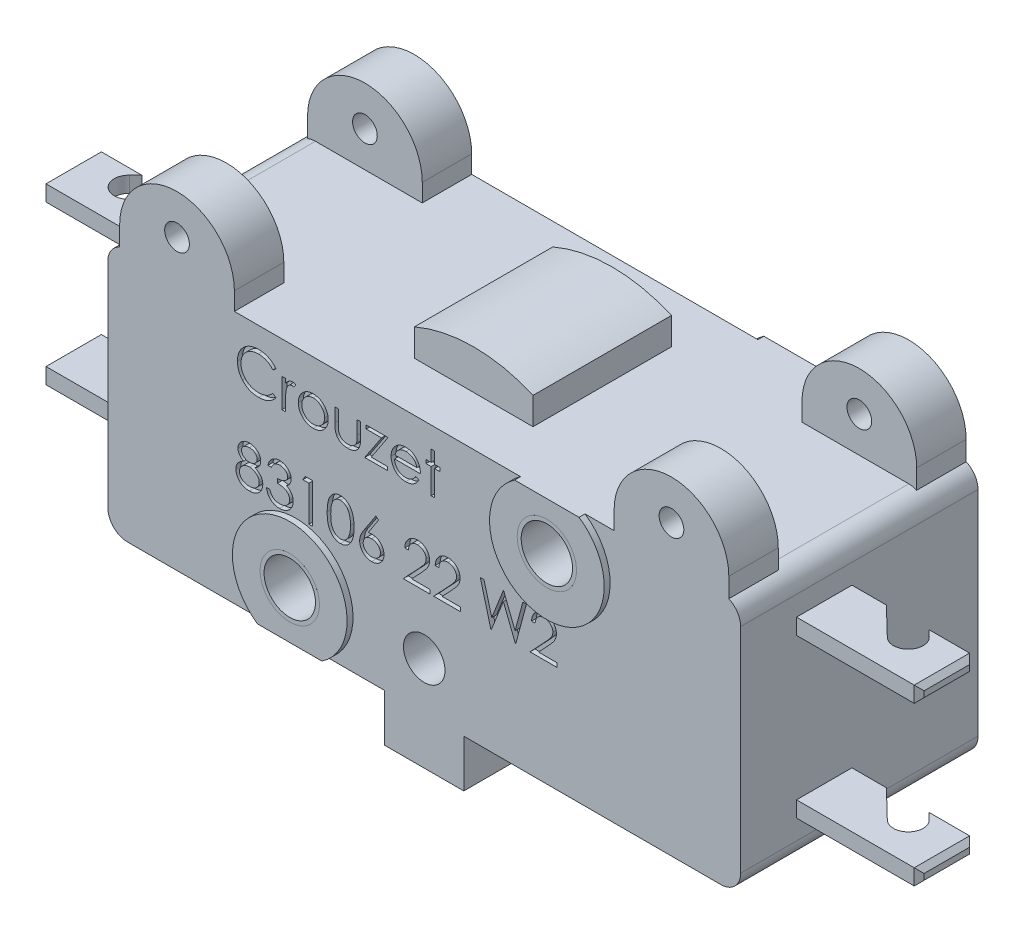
from build123d import *

# Parameters (mm, degrees)
ESQUISSE1_R                  = 0.625
BOSS_EXTRU_1_DEPTH           = 6
ESQUISSE2_W                  = 7
ESQUISSE2_H                  = 3.8
ENL_V_MAT_EXTRU_1_DEPTH      = 50
CONG_1_R                     = 1
ESQUISSE3_R                  = 1.5
ENL_V_MAT_EXTRU_2_DEPTH      = 26.991537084
ESQUISSE4_R                  = 1.05
ENL_V_MAT_EXTRU_3_DEPTH      = 3
ESQUISSE6_R                  = 1.5
BOSS_EXTRU_3_DEPTH           = 0.3
BOSS_EXTRU_4_DEPTH           = 3.5
ESQUISSE5_R                  = 1
BOSS_EXTRU_2_DEPTH           = 1.3
ESQUISSE8_W                  = 6.35
ESQUISSE8_H                  = 0.8
BOSS_EXTRU_5_DEPTH           = 11.5
ENL_V_MAT_EXTRU_6_DEPTH      = 32.365267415
CHANFREIN2_SIZE              = 0.25
CHANFREIN2_OF_SYM_TRIE3_SIZE = 0.25
ENL_V_MAT_EXTRU_7_DEPTH      = 0.25
CONG_2_R                     = 0.25
BOSS_EXTRU_7_START           = -6.3
ESQUISSE21_R                 = 1.5
ESQUISSE21_R_2               = 1.3
BOSS_EXTRU_7_DEPTH           = 12.6
BOSS_EXTRU_7_2_DEPTH         = 12.6


with BuildPart() as part:
    # Esquisse1 → Boss.-Extru.1 (new, symmetric)
    with BuildSketch(Plane.XY):
        with BuildLine():
            Line((-2, 0), (-16, 0))
            Line((-16, 0), (-16, 12.8))
            Line((-16, 12.8), (-15.4, 12.8))
            Line((-15.4, 12.8), (-15.4, 13.7))
            ThreePointArc((-15.4, 13.7), (-12.5, 16.6), (-9.6, 13.7))
            Line((-9.6, 13.7), (-9.6, 12.8))
            Line((-9.6, 12.8), (9.6, 12.8))
            Line((9.6, 12.8), (9.6, 13.7))
            ThreePointArc((9.6, 13.7), (12.5, 16.6), (15.4, 13.7))
            Line((15.4, 13.7), (15.4, 12.8))
            Line((15.4, 12.8), (16, 12.8))
            Line((16, 12.8), (16, 0))
            Line((16, 0), (2, 0))
            Line((2, 0), (2, -2.4))
            Line((2, -2.4), (-2, -2.4))
            Line((-2, -2.4), (-2, 0))
        make_face()
        with Locations((12.5, 14.6)):
            Circle(ESQUISSE1_R, mode=Mode.SUBTRACT)
        with Locations(Location((-12.5, 14.6, 0), (0, 0, 180))):
            Circle(ESQUISSE1_R, mode=Mode.SUBTRACT)
    extrude(amount=BOSS_EXTRU_1_DEPTH, both=True)

    # Esquisse2 → Enl_v. mat.-Extru.1 (cut, symmetric)
    with BuildSketch(Plane(origin=(0, 0, 0), x_dir=(0, 0, -1), z_dir=(1, 0, 0))):
        with Locations((0, 14.7)):
            Rectangle(ESQUISSE2_W, ESQUISSE2_H)
    extrude(amount=ENL_V_MAT_EXTRU_1_DEPTH, both=True, mode=Mode.SUBTRACT)

    # Cong_1
    cong_1_edges = [part.edges().sort_by_distance(p)[0] for p in [
        (16, 12.8, 0),
        (-16, 12.8, 0),
        (-16, 0, 0),
        (16, 0, 0),
    ]]
    fillet(cong_1_edges, radius=CONG_1_R)

    # Esquisse3 → Enl_v. mat.-Extru.2 (cut, through all)
    with BuildSketch(Plane.XY.offset(6)):
        with Locations((-6.5, 2.4)):
            Circle(ESQUISSE3_R)
        with Locations((6.5, 10.4)):
            Circle(ESQUISSE3_R)
    extrude(amount=-ENL_V_MAT_EXTRU_2_DEPTH, mode=Mode.SUBTRACT)

    # Esquisse4 → Enl_v. mat.-Extru.3 (cut)
    with BuildSketch(Plane.XY.offset(6)):
        with Locations((0, 2.4)):
            Circle(ESQUISSE4_R)
    extrude(amount=-ENL_V_MAT_EXTRU_3_DEPTH, mode=Mode.SUBTRACT)

    # Esquisse6 → Boss.-Extru.3 (add)
    # profile 1 of 2: a face of its own
    with BuildSketch(Plane(origin=(0, 0, -6), x_dir=(-1, 0, 0), z_dir=(0, 0, -1))):
        with BuildLine():
            Line((-8.12788206, 12.8), (-4.87211794, 12.8))
            ThreePointArc((-4.87211794, 12.8), (-6.5, 7.5), (-8.12788206, 12.8))
        make_face()
        with Locations(Location((-6.5, 10.4, 0), (0, 0, 180))):
            Circle(ESQUISSE6_R, mode=Mode.SUBTRACT)
    # profile 2 of 2: a face of its own
    with BuildSketch(Plane(origin=(0, 0, -6), x_dir=(-1, 0, 0), z_dir=(0, 0, -1))):
        with BuildLine():
            Line((8.12788206, 0), (4.87211794, 0))
            ThreePointArc((4.87211794, 0), (6.5, 5.3), (8.12788206, 0))
        make_face()
        with Locations(Location((6.5, 2.4, 0), (0, 0, 180))):
            Circle(ESQUISSE6_R, mode=Mode.SUBTRACT)
    boss_extru_3 = extrude(amount=BOSS_EXTRU_3_DEPTH)

    # Esquisse7 → Boss.-Extru.4 (add, symmetric)
    with BuildSketch(Plane.XY):
        with BuildLine():
            Line((-3, 12.8), (3, 12.8))
            Line((3, 12.8), (3, 14.173863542))
            ThreePointArc((3, 14.173863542), (0, 14.8), (-3, 14.173863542))
            Line((-3, 14.173863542), (-3, 12.8))
        make_face()
    extrude(amount=BOSS_EXTRU_4_DEPTH, both=True)

    # Esquisse5 → Boss.-Extru.2 (add)
    with BuildSketch(Plane(origin=(0, 0, -6), x_dir=(-1, 0, 0), z_dir=(0, 0, -1))):
        with Locations(Location((0, 2.4, 0), (0, 0, 180))):
            Circle(ESQUISSE5_R)
    extrude(amount=BOSS_EXTRU_2_DEPTH)

    # Sym_trie2: Boss.-Extru.3 across plane
    add(boss_extru_3.mirror(Plane.XY))

    # Esquisse8 → Boss.-Extru.5 (add)
    with BuildSketch(Plane(origin=(16, 0, 0), x_dir=(0, 0, -1), z_dir=(1, 0, 0))):
        with Locations((0, 10.4)):
            Rectangle(ESQUISSE8_W, ESQUISSE8_H)
        with Locations((0, 2.4)):
            Rectangle(ESQUISSE8_W, ESQUISSE8_H)
    boss_extru_5 = extrude(amount=BOSS_EXTRU_5_DEPTH)

    # Esquisse11 → Enl_v. mat.-Extru.6 (cut, through all)
    with BuildSketch(Plane(origin=(0, 10.8, 0), x_dir=(1, 0, 0), z_dir=(0, 1, 0))):
        with BuildLine():
            Line((16, -0.375), (17.742516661, -0.375))
            Line((17.742516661, -0.375), (19.178559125, -1.764072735))
            ThreePointArc((19.178559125, -1.764072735), (20.239072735, -1.746440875), (20.221440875, -0.685927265))
            Line((20.221440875, -0.685927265), (19.9, -0.375))
            Line((19.9, -0.375), (22.2, -0.375))
            Line((22.2, -0.375), (22.2, -3.175))
            Line((22.2, -3.175), (27.5, -3.175))
            Line((27.5, -3.175), (27.5, 3.175))
            Line((27.5, 3.175), (16, 3.175))
            Line((16, 3.175), (16, -0.375))
        make_face()
    enl_v_mat_extru_6 = extrude(amount=-ENL_V_MAT_EXTRU_6_DEPTH, mode=Mode.SUBTRACT)

    # Chanfrein2
    chanfrein2_edges = [part.edges().sort_by_distance(p)[0] for p in [
        (22.2, 2.8, 1.775),
        (22.2, 10, 1.775),
        (22.2, 10.4, 3.175),
        (22.2, 2, 1.775),
        (22.2, 2.4, 3.175),
        (22.2, 10.4, 0.375),
        (22.2, 2.4, 0.375),
        (22.2, 10.8, 1.775),
    ]]
    chamfer(chanfrein2_edges, length=CHANFREIN2_SIZE)

    # Sym_trie3: Boss.-Extru.5, Enl_v. mat.-Extru.6 across plane
    add(boss_extru_5.mirror(Plane(origin=(0, 0, 0), x_dir=(0, 0, 1), z_dir=(1, 0, 0))))
    add(enl_v_mat_extru_6.mirror(Plane(origin=(0, 0, 0), x_dir=(0, 0, 1), z_dir=(1, 0, 0))), mode=Mode.SUBTRACT)

    # Chanfrein2 of Sym_trie3
    chanfrein2_of_sym_trie3_edges = [part.edges().sort_by_distance(p)[0] for p in [
        (-22.2, 2.8, 1.775),
        (-22.2, 10, 1.775),
        (-22.2, 10.4, 3.175),
        (-22.2, 2, 1.775),
        (-22.2, 2.4, 3.175),
        (-22.2, 10.4, 0.375),
        (-22.2, 2.4, 0.375),
        (-22.2, 10.8, 1.775),
    ]]
    chamfer(chanfrein2_of_sym_trie3_edges, length=CHANFREIN2_OF_SYM_TRIE3_SIZE)

    # Esquisse12 → Enl_v. mat.-Extru.7 (cut)
    # profile 1 of 16: a face of its own
    with BuildSketch(Plane.XY.offset(6)):
        with BuildLine():
            Line((-7.497435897, 11.333012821), (-7.654487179, 11.212820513))
            add(Edge.make_bspline(
                [(-7.654487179, 11.212820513), (-7.665690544, 11.226172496), (-7.687946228, 11.252696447), (-7.723751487, 11.289941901), (-7.761066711, 11.324836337), (-7.799877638, 11.357545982), (-7.840882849, 11.386926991), (-7.883089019, 11.414510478), (-7.927202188, 11.4392349), (-7.988203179, 11.469213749), (-8.06800195, 11.500497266), (-8.168456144, 11.526727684), (-8.273319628, 11.543425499), (-8.344861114, 11.54523398), (-8.38125, 11.546153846)],
                knots=[0, 0, 0, 0, 0.757959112, 1.505699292, 2.245454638, 2.979532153, 3.711538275, 4.438200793, 5.171680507, 5.909471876, 7.393775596, 8.890124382, 10.418191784, 12, 12, 12, 12], degree=3))
            add(Edge.make_bspline(
                [(-8.38125, 11.546153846), (-8.4012976, 11.54592301), (-8.441206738, 11.545463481), (-8.500434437, 11.539401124), (-8.558556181, 11.530880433), (-8.615534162, 11.518237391), (-8.671295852, 11.502253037), (-8.726205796, 11.483152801), (-8.779468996, 11.459521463), (-8.831822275, 11.433402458), (-8.881981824, 11.403901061), (-8.929441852, 11.371722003), (-8.974029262, 11.337225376), (-9.015779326, 11.300281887), (-9.054734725, 11.261057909), (-9.090613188, 11.219135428), (-9.123290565, 11.174648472), (-9.15341458, 11.128183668), (-9.180393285, 11.079876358), (-9.202981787, 11.029547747), (-9.222984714, 10.978059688), (-9.238812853, 10.924830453), (-9.251341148, 10.870234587), (-9.259985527, 10.814125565), (-9.265978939, 10.756620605), (-9.266436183, 10.717643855), (-9.266666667, 10.697996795)],
                knots=[0, 0, 0, 0, 1.054917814, 2.100044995, 3.131103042, 4.146048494, 5.169673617, 6.183595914, 7.203665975, 8.234915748, 9.262203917, 10.264457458, 11.251630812, 12.227803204, 13.197192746, 14.159520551, 15.12972552, 16.100847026, 17.073214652, 18.039054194, 19.002613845, 19.979014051, 20.95965708, 21.949030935, 22.966165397, 24, 24, 24, 24], degree=3))
            add(Edge.make_bspline(
                [(-9.266666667, 10.697996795), (-9.265945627, 10.668436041), (-9.264529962, 10.610397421), (-9.251930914, 10.525385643), (-9.232785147, 10.443945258), (-9.204090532, 10.366585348), (-9.168708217, 10.292352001), (-9.123999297, 10.222501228), (-9.072218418, 10.155977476), (-9.012633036, 10.094352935), (-8.947258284, 10.038059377), (-8.87711662, 9.988487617), (-8.802382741, 9.947164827), (-8.723881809, 9.912778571), (-8.641009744, 9.886346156), (-8.553915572, 9.867738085), (-8.462788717, 9.855599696), (-8.400520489, 9.854437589), (-8.368830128, 9.853846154)],
                knots=[0, 0, 0, 0, 1.029171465, 2.020641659, 2.987623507, 3.938342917, 4.889210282, 5.84687017, 6.821220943, 7.821438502, 8.827599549, 9.822697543, 10.807740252, 11.797342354, 12.80366471, 13.83203677, 14.896651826, 16, 16, 16, 16], degree=3))
            add(Edge.make_bspline(
                [(-8.368830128, 9.853846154), (-8.333914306, 9.854811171), (-8.265191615, 9.856710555), (-8.164409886, 9.872801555), (-8.067932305, 9.898891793), (-7.975753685, 9.935404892), (-7.888133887, 9.982870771), (-7.804935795, 10.040412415), (-7.726089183, 10.108577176), (-7.678677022, 10.160624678), (-7.654487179, 10.187179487)],
                knots=[0, 0, 0, 0, 1.028121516, 2.023589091, 2.998037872, 3.967518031, 4.937445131, 5.927275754, 6.942489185, 8, 8, 8, 8], degree=3))
            Line((-7.654487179, 10.187179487), (-7.497435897, 10.068189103))
            add(Edge.make_bspline(
                [(-7.497435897, 10.068189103), (-7.510074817, 10.051881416), (-7.535292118, 10.019344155), (-7.57612527, 9.973474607), (-7.619140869, 9.930329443), (-7.664658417, 9.890256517), (-7.712154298, 9.852453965), (-7.762481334, 9.817995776), (-7.814977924, 9.786400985), (-7.869466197, 9.757471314), (-7.925888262, 9.731804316), (-7.98417651, 9.709830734), (-8.044079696, 9.690902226), (-8.105600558, 9.67532969), (-8.168866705, 9.663174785), (-8.233649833, 9.655049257), (-8.300089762, 9.649482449), (-8.344913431, 9.648975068), (-8.367628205, 9.648717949)],
                knots=[0, 0, 0, 0, 0.986787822, 1.968848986, 2.935600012, 3.899624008, 4.868462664, 5.837806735, 6.815139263, 7.798259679, 8.787526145, 9.778297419, 10.776456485, 11.791383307, 12.812564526, 13.85620153, 14.913611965, 16, 16, 16, 16], degree=3))
            add(Edge.make_bspline(
                [(-8.367628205, 9.648717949), (-8.389138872, 9.648867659), (-8.431673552, 9.649163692), (-8.494472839, 9.653959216), (-8.555609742, 9.660501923), (-8.614909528, 9.670353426), (-8.6726958, 9.681978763), (-8.728444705, 9.697562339), (-8.782704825, 9.715019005), (-8.835258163, 9.735536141), (-8.88614942, 9.758688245), (-8.935214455, 9.78485485), (-8.982430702, 9.813815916), (-9.028262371, 9.844933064), (-9.072032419, 9.879205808), (-9.114120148, 9.916158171), (-9.154761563, 9.955665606), (-9.179905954, 9.984154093), (-9.192548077, 9.998477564)],
                knots=[0, 0, 0, 0, 1.114604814, 2.203992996, 3.262667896, 4.300477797, 5.318619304, 6.316056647, 7.298880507, 8.271930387, 9.238335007, 10.195173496, 11.151986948, 12.108099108, 13.064862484, 14.031167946, 15.010108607, 16, 16, 16, 16], degree=3))
            add(Edge.make_bspline(
                [(-9.192548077, 9.998477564), (-9.212797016, 10.023358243), (-9.253050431, 10.072819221), (-9.304550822, 10.152982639), (-9.348635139, 10.236678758), (-9.384278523, 10.324347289), (-9.412142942, 10.41579151), (-9.431446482, 10.511057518), (-9.443990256, 10.610056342), (-9.445424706, 10.67739165), (-9.446153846, 10.71161859)],
                knots=[0, 0, 0, 0, 0.994628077, 1.977248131, 2.950237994, 3.925870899, 4.908910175, 5.911660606, 6.938484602, 8, 8, 8, 8], degree=3))
            add(Edge.make_bspline(
                [(-9.446153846, 10.71161859), (-9.445265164, 10.747593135), (-9.443516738, 10.818370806), (-9.428661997, 10.922241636), (-9.404765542, 11.021756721), (-9.370824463, 11.11673029), (-9.327792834, 11.207661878), (-9.274634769, 11.293856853), (-9.21196783, 11.375866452), (-9.140283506, 11.45244631), (-9.0616736, 11.522468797), (-8.977491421, 11.584072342), (-8.887901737, 11.635339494), (-8.793891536, 11.678194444), (-8.694756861, 11.711134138), (-8.590709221, 11.734193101), (-8.481944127, 11.748545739), (-8.407737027, 11.750360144), (-8.370032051, 11.751282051)],
                knots=[0, 0, 0, 0, 1.032925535, 2.032216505, 3.007276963, 3.968222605, 4.92396291, 5.891752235, 6.871517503, 7.883894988, 8.900124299, 9.891468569, 10.874487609, 11.85992873, 12.854644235, 13.869047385, 14.917252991, 16, 16, 16, 16], degree=3))
            add(Edge.make_bspline(
                [(-8.370032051, 11.751282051), (-8.347052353, 11.751006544), (-8.301566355, 11.750461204), (-8.234279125, 11.745143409), (-8.168769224, 11.736278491), (-8.104991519, 11.724212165), (-8.042635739, 11.709236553), (-7.982178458, 11.689727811), (-7.923264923, 11.667421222), (-7.86626669, 11.64173067), (-7.811457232, 11.612892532), (-7.758853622, 11.581226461), (-7.708873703, 11.546771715), (-7.661165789, 11.509821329), (-7.616527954, 11.469593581), (-7.573692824, 11.427194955), (-7.534115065, 11.381404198), (-7.509684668, 11.349172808), (-7.497435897, 11.333012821)],
                knots=[0, 0, 0, 0, 1.096760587, 2.17092713, 3.219439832, 4.250915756, 5.268269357, 6.278326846, 7.281116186, 8.274029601, 9.260640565, 10.235837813, 11.203064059, 12.156899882, 13.114053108, 14.069676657, 15.032185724, 16, 16, 16, 16], degree=3))
        make_face()
    # profile 2 of 16: a face of its own
    with BuildSketch(Plane.XY.offset(6)):
        with BuildLine():
            Line((-7.18974359, 11.161538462), (-7.01025641, 11.161538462))
            Line((-7.01025641, 11.161538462), (-7.01025641, 10.946394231))
            add(Edge.make_bspline(
                [(-7.01025641, 10.946394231), (-6.997005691, 10.966426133), (-6.971663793, 11.004736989), (-6.929542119, 11.055405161), (-6.886397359, 11.097356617), (-6.842022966, 11.130787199), (-6.796092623, 11.155823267), (-6.749614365, 11.174162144), (-6.701856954, 11.185006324), (-6.669764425, 11.186454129), (-6.653685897, 11.187179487)],
                knots=[0, 0, 0, 0, 1.2804753, 2.448899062, 3.506932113, 4.484331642, 5.4025378, 6.288909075, 7.142734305, 8, 8, 8, 8], degree=3))
            add(Edge.make_bspline(
                [(-6.653685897, 11.187179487), (-6.641213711, 11.186499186), (-6.615551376, 11.185099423), (-6.576704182, 11.175264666), (-6.536679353, 11.159562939), (-6.510883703, 11.144797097), (-6.497435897, 11.137099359)],
                knots=[0, 0, 0, 0, 0.901110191, 1.854092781, 2.881294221, 4, 4, 4, 4], degree=3))
            Line((-6.497435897, 11.137099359), (-6.59599359, 10.981650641))
            add(Edge.make_bspline(
                [(-6.59599359, 10.981650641), (-6.604627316, 10.985502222), (-6.621015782, 10.992813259), (-6.644989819, 11.001465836), (-6.66709344, 11.006560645), (-6.681175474, 11.007332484), (-6.687740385, 11.007692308)],
                knots=[0, 0, 0, 0, 1.180555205, 2.24091978, 3.179933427, 4, 4, 4, 4], degree=3))
            add(Edge.make_bspline(
                [(-6.687740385, 11.007692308), (-6.702143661, 11.006732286), (-6.731522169, 11.004774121), (-6.774656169, 10.989380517), (-6.816511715, 10.964508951), (-6.849752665, 10.936925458), (-6.875491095, 10.910326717), (-6.893856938, 10.887099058), (-6.910704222, 10.861054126), (-6.926801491, 10.832637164), (-6.941467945, 10.801362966), (-6.955156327, 10.767543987), (-6.967532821, 10.731141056), (-6.974590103, 10.705779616), (-6.978205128, 10.692788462)],
                knots=[0, 0, 0, 0, 1.125678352, 2.296057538, 3.5422874, 4.923748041, 5.663163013, 6.437101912, 7.23742474, 8.08941207, 8.991984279, 9.93940061, 10.944477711, 12, 12, 12, 12], degree=3))
            add(Edge.make_bspline(
                [(-6.978205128, 10.692788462), (-6.980909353, 10.681201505), (-6.986899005, 10.655537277), (-6.992722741, 10.612480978), (-6.998476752, 10.561610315), (-7.002531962, 10.502783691), (-7.006290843, 10.436148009), (-7.00841089, 10.361601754), (-7.010184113, 10.279068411), (-7.01023158, 10.22136878), (-7.01025641, 10.191185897)],
                knots=[0, 0, 0, 0, 0.566838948, 1.255505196, 2.06880316, 3.007127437, 4.065329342, 5.249902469, 6.561414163, 8, 8, 8, 8], degree=3))
            Line((-7.01025641, 10.191185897), (-7.01025641, 9.7))
            Line((-7.01025641, 9.7), (-7.18974359, 9.7))
            Line((-7.18974359, 9.7), (-7.18974359, 11.161538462))
        make_face()
    # profile 3 of 16: a face of its own
    with BuildSketch(Plane.XY.offset(6)):
        with BuildLine():
            add(Edge.make_bspline(
                [(-5.612019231, 11.187179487), (-5.584595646, 11.186595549), (-5.530824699, 11.18545059), (-5.452077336, 11.173213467), (-5.376908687, 11.154500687), (-5.305030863, 11.128631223), (-5.237364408, 11.093955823), (-5.172923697, 11.052579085), (-5.111885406, 11.00356046), (-5.075300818, 10.965641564), (-5.056730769, 10.946394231)],
                knots=[0, 0, 0, 0, 1.054011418, 2.066658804, 3.057071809, 4.030435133, 4.997543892, 5.974964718, 6.972108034, 8, 8, 8, 8], degree=3))
            add(Edge.make_bspline(
                [(-5.056730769, 10.946394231), (-5.040741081, 10.927986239), (-5.00907115, 10.8915265), (-4.968462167, 10.832409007), (-4.933478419, 10.771186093), (-4.905442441, 10.707044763), (-4.883336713, 10.640544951), (-4.86764203, 10.571458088), (-4.858306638, 10.499936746), (-4.8570478, 10.451363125), (-4.856410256, 10.426762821)],
                knots=[0, 0, 0, 0, 1.025258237, 2.030674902, 3.01204498, 3.988269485, 4.97094183, 5.956517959, 6.965070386, 8, 8, 8, 8], degree=3))
            add(Edge.make_bspline(
                [(-4.856410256, 10.426762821), (-4.856971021, 10.40201993), (-4.858079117, 10.353126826), (-4.868561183, 10.281115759), (-4.884864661, 10.211290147), (-4.90819714, 10.143942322), (-4.938116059, 10.07886642), (-4.974625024, 10.016346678), (-5.017980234, 9.956259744), (-5.067125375, 9.899115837), (-5.121440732, 9.846449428), (-5.180364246, 9.80054756), (-5.242737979, 9.761220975), (-5.309391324, 9.729543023), (-5.379715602, 9.704566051), (-5.453862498, 9.687023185), (-5.531716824, 9.676416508), (-5.584875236, 9.675054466), (-5.612019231, 9.674358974)],
                knots=[0, 0, 0, 0, 0.998656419, 1.973391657, 2.932242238, 3.890759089, 4.846373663, 5.82037756, 6.809684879, 7.83454468, 8.860553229, 9.859544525, 10.845671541, 11.83227036, 12.833544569, 13.85385346, 14.904124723, 16, 16, 16, 16], degree=3))
            add(Edge.make_bspline(
                [(-5.612019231, 9.674358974), (-5.639296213, 9.675056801), (-5.692719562, 9.676423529), (-5.770848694, 9.686981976), (-5.845128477, 9.704557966), (-5.915544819, 9.729625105), (-5.982484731, 9.761221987), (-6.045219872, 9.800428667), (-6.104191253, 9.846463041), (-6.158518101, 9.899112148), (-6.207660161, 9.956260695), (-6.251016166, 10.016346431), (-6.287524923, 10.078866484), (-6.317443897, 10.143942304), (-6.340776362, 10.211290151), (-6.357079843, 10.281115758), (-6.367561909, 10.353126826), (-6.368670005, 10.402019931), (-6.369230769, 10.426762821)],
                knots=[0, 0, 0, 0, 1.099876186, 2.154163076, 3.173186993, 4.173200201, 5.163417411, 6.152872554, 7.150605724, 8.17532212, 9.198891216, 10.186952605, 11.159729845, 12.11414092, 13.071450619, 14.029093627, 15.002601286, 16, 16, 16, 16], degree=3))
            add(Edge.make_bspline(
                [(-6.369230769, 10.426762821), (-6.368588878, 10.451229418), (-6.367318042, 10.499669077), (-6.357992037, 10.571055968), (-6.342358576, 10.640025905), (-6.32022635, 10.706269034), (-6.291931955, 10.770129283), (-6.257439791, 10.831503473), (-6.216416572, 10.890353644), (-6.1848726, 10.926766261), (-6.168910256, 10.945192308)],
                knots=[0, 0, 0, 0, 1.031353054, 2.041901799, 3.029428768, 4.008703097, 4.981709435, 5.96992636, 6.972712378, 8, 8, 8, 8], degree=3))
            add(Edge.make_bspline(
                [(-6.168910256, 10.945192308), (-6.150368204, 10.964606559), (-6.113901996, 11.002788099), (-6.052559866, 11.051663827), (-5.988277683, 11.093901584), (-5.919863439, 11.127887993), (-5.848044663, 11.15465286), (-5.772490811, 11.173261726), (-5.69347623, 11.1854065), (-5.639442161, 11.186582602), (-5.612019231, 11.187179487)],
                knots=[0, 0, 0, 0, 1.027980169, 2.021703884, 2.998553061, 3.971491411, 4.943284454, 5.930300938, 6.949603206, 8, 8, 8, 8], degree=3))
        make_face()
        with BuildLine():
            add(Edge.make_bspline(
                [(-5.612820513, 11.007692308), (-5.632213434, 11.007141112), (-5.67049865, 11.006052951), (-5.726852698, 10.997776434), (-5.781104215, 10.984663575), (-5.833356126, 10.966032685), (-5.883432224, 10.941976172), (-5.931380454, 10.912428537), (-5.977341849, 10.877781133), (-6.020417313, 10.838088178), (-6.059950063, 10.794728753), (-6.094508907, 10.748529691), (-6.123894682, 10.70024035), (-6.148374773, 10.649810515), (-6.166607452, 10.596729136), (-6.179849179, 10.541597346), (-6.188117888, 10.484302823), (-6.189195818, 10.445353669), (-6.18974359, 10.425560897)],
                knots=[0, 0, 0, 0, 1.021534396, 2.016698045, 2.994645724, 3.958388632, 4.93408049, 5.916473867, 6.921342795, 7.962252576, 8.998418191, 10.008913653, 10.997312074, 11.973003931, 12.956656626, 13.948281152, 14.957379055, 16, 16, 16, 16], degree=3))
            add(Edge.make_bspline(
                [(-6.18974359, 10.425560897), (-6.188825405, 10.39998831), (-6.187002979, 10.349231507), (-6.172182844, 10.274482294), (-6.147390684, 10.202721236), (-6.113912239, 10.134369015), (-6.071965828, 10.071127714), (-6.022544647, 10.014744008), (-5.966179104, 9.966066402), (-5.903541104, 9.925677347), (-5.835910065, 9.893586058), (-5.764335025, 9.870843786), (-5.689683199, 9.856059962), (-5.638665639, 9.854590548), (-5.612820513, 9.853846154)],
                knots=[0, 0, 0, 0, 1.016792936, 2.018143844, 3.017858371, 4.030088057, 5.03801393, 6.028138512, 7.003788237, 7.991172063, 8.984598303, 9.972568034, 10.972917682, 12, 12, 12, 12], degree=3))
            add(Edge.make_bspline(
                [(-5.612820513, 9.853846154), (-5.586976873, 9.854594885), (-5.535962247, 9.856072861), (-5.461414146, 9.870769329), (-5.390034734, 9.893685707), (-5.322473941, 9.925641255), (-5.259864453, 9.966219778), (-5.203093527, 10.014469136), (-5.15409432, 10.071277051), (-5.112189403, 10.134452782), (-5.078162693, 10.202615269), (-5.053486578, 10.274495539), (-5.038630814, 10.349228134), (-5.036813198, 10.39998718), (-5.035897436, 10.425560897)],
                knots=[0, 0, 0, 0, 1.02726834, 2.027799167, 3.010890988, 4.004497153, 4.992059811, 5.971914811, 6.958719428, 7.966827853, 8.981595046, 9.981490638, 10.983022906, 12, 12, 12, 12], degree=3))
            add(Edge.make_bspline(
                [(-5.035897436, 10.425560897), (-5.036445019, 10.445353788), (-5.037522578, 10.484303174), (-5.045793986, 10.541596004), (-5.059025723, 10.596734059), (-5.077295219, 10.649792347), (-5.101668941, 10.700370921), (-5.131621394, 10.748387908), (-5.166039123, 10.794888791), (-5.206048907, 10.837948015), (-5.249079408, 10.877796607), (-5.29505943, 10.912441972), (-5.342936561, 10.941846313), (-5.392867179, 10.96623845), (-5.445125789, 10.984494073), (-5.499301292, 10.997852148), (-5.555414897, 11.006017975), (-5.593562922, 11.007130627), (-5.612820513, 11.007692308)],
                knots=[0, 0, 0, 0, 1.042956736, 2.052379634, 3.044323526, 4.02829302, 5.004299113, 5.996692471, 7.007513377, 8.048758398, 9.090003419, 10.095195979, 11.07790575, 12.047570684, 13.018257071, 13.989683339, 14.985167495, 16, 16, 16, 16], degree=3))
        make_face(mode=Mode.SUBTRACT)
    # profile 4 of 16: a face of its own
    with BuildSketch(Plane.XY.offset(6)):
        with BuildLine():
            Line((-4.523076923, 11.161538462), (-4.343589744, 11.161538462))
            Line((-4.343589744, 11.161538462), (-4.343589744, 10.483653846))
            add(Edge.make_bspline(
                [(-4.343589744, 10.483653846), (-4.343508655, 10.463755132), (-4.343353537, 10.425689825), (-4.34230157, 10.370915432), (-4.339827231, 10.320963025), (-4.336733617, 10.275803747), (-4.332755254, 10.235445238), (-4.328021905, 10.200028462), (-4.322731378, 10.169151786), (-4.317552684, 10.150555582), (-4.315144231, 10.141907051)],
                knots=[0, 0, 0, 0, 1.388932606, 2.656963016, 3.823490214, 4.879454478, 5.816252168, 6.653371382, 7.373723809, 8, 8, 8, 8], degree=3))
            add(Edge.make_bspline(
                [(-4.315144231, 10.141907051), (-4.311280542, 10.131036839), (-4.30363349, 10.109522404), (-4.289762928, 10.078442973), (-4.272603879, 10.049657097), (-4.253826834, 10.02205477), (-4.23217003, 9.996453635), (-4.207907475, 9.972896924), (-4.181851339, 9.950494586), (-4.143134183, 9.923988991), (-4.090186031, 9.895580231), (-4.020670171, 9.871068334), (-3.945296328, 9.856419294), (-3.893202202, 9.85471972), (-3.866426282, 9.853846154)],
                knots=[0, 0, 0, 0, 0.725840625, 1.436591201, 2.137033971, 2.831655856, 3.53531722, 4.242432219, 4.957935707, 5.694543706, 7.190802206, 8.724350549, 10.316345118, 12, 12, 12, 12], degree=3))
            add(Edge.make_bspline(
                [(-3.866426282, 9.853846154), (-3.839652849, 9.854738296), (-3.78785121, 9.856464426), (-3.713305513, 9.870626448), (-3.645161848, 9.894286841), (-3.584104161, 9.927319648), (-3.530409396, 9.967743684), (-3.485664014, 10.015177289), (-3.448745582, 10.068119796), (-3.432625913, 10.107619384), (-3.424519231, 10.127483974)],
                knots=[0, 0, 0, 0, 1.157059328, 2.238695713, 3.266970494, 4.264342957, 5.228770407, 6.160125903, 7.074715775, 8, 8, 8, 8], degree=3))
            add(Edge.make_bspline(
                [(-3.424519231, 10.127483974), (-3.422122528, 10.135464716), (-3.416824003, 10.153108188), (-3.411131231, 10.183039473), (-3.406002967, 10.218733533), (-3.401624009, 10.260423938), (-3.398501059, 10.308001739), (-3.396817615, 10.361452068), (-3.394915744, 10.420607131), (-3.394886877, 10.462017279), (-3.394871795, 10.483653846)],
                knots=[0, 0, 0, 0, 0.557542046, 1.232589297, 2.036731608, 2.971723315, 4.038036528, 5.22795436, 6.551621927, 8, 8, 8, 8], degree=3))
            Line((-3.394871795, 10.483653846), (-3.394871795, 11.161538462))
            Line((-3.394871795, 11.161538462), (-3.215384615, 11.161538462))
            Line((-3.215384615, 11.161538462), (-3.215384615, 10.45))
            add(Edge.make_bspline(
                [(-3.215384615, 10.45), (-3.215637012, 10.425824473), (-3.216126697, 10.378920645), (-3.219273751, 10.310758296), (-3.224673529, 10.247237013), (-3.232869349, 10.188323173), (-3.242506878, 10.134061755), (-3.254939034, 10.084383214), (-3.269783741, 10.039440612), (-3.286529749, 9.998445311), (-3.306313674, 9.961275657), (-3.327357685, 9.925998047), (-3.351657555, 9.893487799), (-3.377240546, 9.862126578), (-3.405698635, 9.833474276), (-3.436498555, 9.806873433), (-3.469206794, 9.781917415), (-3.504549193, 9.759579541), (-3.542009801, 9.739455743), (-3.581634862, 9.721617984), (-3.623909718, 9.707502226), (-3.668288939, 9.695324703), (-3.714989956, 9.685773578), (-3.763967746, 9.679038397), (-3.815205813, 9.674909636), (-3.850125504, 9.67454561), (-3.868028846, 9.674358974)],
                knots=[0, 0, 0, 0, 1.493040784, 2.896703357, 4.213163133, 5.428574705, 6.569057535, 7.615249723, 8.588095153, 9.490268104, 10.346124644, 11.18633936, 12.024365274, 12.850166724, 13.684164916, 14.514361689, 15.362232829, 16.222528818, 17.093394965, 17.986930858, 18.902426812, 19.842810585, 20.827885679, 21.843828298, 22.894529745, 24, 24, 24, 24], degree=3))
            add(Edge.make_bspline(
                [(-3.868028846, 9.674358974), (-3.885798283, 9.674553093), (-3.92071688, 9.674934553), (-3.971957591, 9.679015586), (-4.02107108, 9.685763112), (-4.067882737, 9.695394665), (-4.112439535, 9.707416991), (-4.154921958, 9.721704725), (-4.194832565, 9.739465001), (-4.232650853, 9.759452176), (-4.268080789, 9.782060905), (-4.301285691, 9.806842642), (-4.332221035, 9.833760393), (-4.360893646, 9.862701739), (-4.386901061, 9.894025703), (-4.41056737, 9.927480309), (-4.432256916, 9.962734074), (-4.451887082, 10.000484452), (-4.468750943, 10.041954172), (-4.483639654, 10.087838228), (-4.495817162, 10.138639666), (-4.505727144, 10.194315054), (-4.513699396, 10.254597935), (-4.519234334, 10.319837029), (-4.522329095, 10.389873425), (-4.522822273, 10.43824479), (-4.523076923, 10.463221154)],
                knots=[0, 0, 0, 0, 1.083640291, 2.129454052, 3.13281866, 4.105697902, 5.042300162, 5.946461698, 6.836384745, 7.703652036, 8.553297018, 9.397182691, 10.228592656, 11.052265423, 11.879314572, 12.708807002, 13.549817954, 14.402308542, 15.300838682, 16.27712199, 17.341985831, 18.484375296, 19.725102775, 21.0496083, 22.476576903, 24, 24, 24, 24], degree=3))
            Line((-4.523076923, 10.463221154), (-4.523076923, 11.161538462))
        make_face()
    # profile 5 of 16: a face of its own
    with BuildSketch(Plane.XY.offset(6)):
        Polygon((-2.933333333, 11.161538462), (-1.830769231, 11.161538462), (-2.680929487, 9.879487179), (-1.856410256, 9.879487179), (-1.856410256, 9.7), (-3.01025641, 9.7), (-2.159695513, 10.982051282), (-2.933333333, 10.982051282), align=None)
    # profile 6 of 16: a face of its own
    with BuildSketch(Plane.XY.offset(6)):
        with BuildLine():
            Line((-0.426121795, 10.161538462), (-0.266666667, 10.077804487))
            add(Edge.make_bspline(
                [(-0.266666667, 10.077804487), (-0.279373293, 10.055265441), (-0.304095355, 10.011413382), (-0.346610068, 9.951166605), (-0.391176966, 9.89696791), (-0.439807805, 9.85026525), (-0.491047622, 9.809550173), (-0.545180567, 9.773928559), (-0.602488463, 9.743575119), (-0.66297402, 9.718002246), (-0.727145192, 9.698339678), (-0.795157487, 9.684451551), (-0.867141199, 9.675866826), (-0.916481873, 9.674869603), (-0.941746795, 9.674358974)],
                knots=[0, 0, 0, 0, 1.120438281, 2.179929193, 3.190490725, 4.156257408, 5.095198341, 6.022838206, 6.959905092, 7.901321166, 8.864066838, 9.862729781, 10.905609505, 12, 12, 12, 12], degree=3))
            add(Edge.make_bspline(
                [(-0.941746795, 9.674358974), (-0.969827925, 9.675014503), (-1.024606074, 9.67629325), (-1.104343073, 9.687317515), (-1.179417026, 9.70530172), (-1.249823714, 9.730424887), (-1.315390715, 9.763240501), (-1.376248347, 9.803217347), (-1.432716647, 9.850150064), (-1.483016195, 9.904445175), (-1.528298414, 9.96254915), (-1.568256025, 10.02309537), (-1.601660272, 10.085931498), (-1.628833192, 10.150657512), (-1.650778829, 10.216865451), (-1.666074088, 10.285157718), (-1.674891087, 10.355349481), (-1.676242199, 10.402833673), (-1.676923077, 10.426762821)],
                knots=[0, 0, 0, 0, 1.145258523, 2.234067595, 3.276747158, 4.290159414, 5.277019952, 6.260822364, 7.254936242, 8.264827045, 9.274100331, 10.257902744, 11.220704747, 12.172965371, 13.118907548, 14.062713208, 15.023725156, 16, 16, 16, 16], degree=3))
            add(Edge.make_bspline(
                [(-1.676923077, 10.426762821), (-1.676317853, 10.449217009), (-1.67511838, 10.493718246), (-1.66755793, 10.559584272), (-1.654158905, 10.62360053), (-1.635772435, 10.685820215), (-1.612028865, 10.746139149), (-1.582981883, 10.804594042), (-1.548586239, 10.861122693), (-1.522030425, 10.896781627), (-1.508653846, 10.91474359)],
                knots=[0, 0, 0, 0, 1.024358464, 2.0301432, 3.019427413, 4.004406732, 4.986367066, 5.972626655, 6.978780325, 8, 8, 8, 8], degree=3))
            add(Edge.make_bspline(
                [(-1.508653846, 10.91474359), (-1.49053517, 10.936382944), (-1.454871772, 10.978976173), (-1.394553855, 11.03494093), (-1.329239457, 11.081823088), (-1.259747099, 11.120684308), (-1.185269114, 11.150212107), (-1.106806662, 11.172216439), (-1.023466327, 11.184546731), (-0.966491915, 11.186288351), (-0.937339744, 11.187179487)],
                knots=[0, 0, 0, 0, 1.030682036, 2.02871468, 2.997146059, 3.962720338, 4.930598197, 5.918074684, 6.934738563, 8, 8, 8, 8], degree=3))
            add(Edge.make_bspline(
                [(-0.937339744, 11.187179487), (-0.907369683, 11.186405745), (-0.848575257, 11.184887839), (-0.762842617, 11.170815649), (-0.681722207, 11.148499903), (-0.60524649, 11.116983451), (-0.533407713, 11.07632085), (-0.466672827, 11.025954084), (-0.403900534, 10.967429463), (-0.367381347, 10.922421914), (-0.348798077, 10.899519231)],
                knots=[0, 0, 0, 0, 1.056321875, 2.072262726, 3.055038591, 4.01806755, 4.982017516, 5.957941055, 6.960871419, 8, 8, 8, 8], degree=3))
            add(Edge.make_bspline(
                [(-0.348798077, 10.899519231), (-0.336154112, 10.882260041), (-0.310950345, 10.847856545), (-0.279380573, 10.791758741), (-0.251976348, 10.733066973), (-0.230071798, 10.670832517), (-0.212334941, 10.605792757), (-0.199502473, 10.537482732), (-0.191976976, 10.465922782), (-0.190497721, 10.417164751), (-0.18974359, 10.392307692)],
                knots=[0, 0, 0, 0, 0.94817472, 1.890038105, 2.849395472, 3.817997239, 4.812318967, 5.836947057, 6.897266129, 8, 8, 8, 8], degree=3))
            Line((-0.18974359, 10.392307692), (-1.497435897, 10.392307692))
            add(Edge.make_bspline(
                [(-1.497435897, 10.392307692), (-1.496556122, 10.373050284), (-1.49482608, 10.335181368), (-1.486760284, 10.279769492), (-1.474046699, 10.226984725), (-1.456178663, 10.177222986), (-1.434540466, 10.129834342), (-1.408034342, 10.085170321), (-1.37641174, 10.043434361), (-1.341139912, 10.00425314), (-1.301878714, 9.969361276), (-1.260574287, 9.93813169), (-1.216635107, 9.911957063), (-1.170407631, 9.890711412), (-1.121966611, 9.874079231), (-1.071296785, 9.862726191), (-1.018497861, 9.85512213), (-0.982506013, 9.854276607), (-0.964182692, 9.853846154)],
                knots=[0, 0, 0, 0, 1.094153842, 2.151609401, 3.174256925, 4.172055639, 5.149267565, 6.128595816, 7.11444997, 8.118368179, 9.117203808, 10.09244225, 11.054858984, 12.015122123, 12.976791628, 13.957293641, 14.960065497, 16, 16, 16, 16], degree=3))
            add(Edge.make_bspline(
                [(-0.964182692, 9.853846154), (-0.946267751, 9.854193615), (-0.91072107, 9.854883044), (-0.857783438, 9.861586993), (-0.805703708, 9.872427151), (-0.754697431, 9.887221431), (-0.705799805, 9.905265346), (-0.660516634, 9.927038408), (-0.618870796, 9.951123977), (-0.579946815, 9.978672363), (-0.542191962, 10.012391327), (-0.504739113, 10.054468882), (-0.464581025, 10.104233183), (-0.439444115, 10.14168785), (-0.426121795, 10.161538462)],
                knots=[0, 0, 0, 0, 0.99110716, 1.966546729, 2.947904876, 3.932708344, 4.903319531, 5.828989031, 6.710028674, 7.56322171, 8.463672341, 9.504779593, 10.677557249, 12, 12, 12, 12], degree=3))
        make_face()
        with BuildLine():
            add(Edge.make_bspline(
                [(-0.369230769, 10.571794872), (-0.375800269, 10.595602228), (-0.388444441, 10.641423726), (-0.414865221, 10.704875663), (-0.444620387, 10.761268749), (-0.479832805, 10.810171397), (-0.51972922, 10.853601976), (-0.565812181, 10.891555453), (-0.617489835, 10.925508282), (-0.674495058, 10.954166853), (-0.734861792, 10.978561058), (-0.79806533, 10.994918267), (-0.862555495, 11.00612372), (-0.906175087, 11.00716721), (-0.928125, 11.007692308)],
                knots=[0, 0, 0, 0, 1.154881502, 2.222775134, 3.210006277, 4.132804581, 5.035138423, 5.962687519, 6.919655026, 7.923214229, 8.944639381, 9.960483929, 10.97369054, 12, 12, 12, 12], degree=3))
            add(Edge.make_bspline(
                [(-0.928125, 11.007692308), (-0.946038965, 11.007342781), (-0.981451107, 11.00665184), (-1.033623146, 11.000097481), (-1.083725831, 10.989263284), (-1.132128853, 10.974426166), (-1.17819792, 10.954649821), (-1.222880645, 10.931459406), (-1.265040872, 10.90314993), (-1.291407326, 10.881573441), (-1.304727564, 10.870673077)],
                knots=[0, 0, 0, 0, 1.04873581, 2.073130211, 3.073294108, 4.04793562, 5.032784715, 6.005352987, 6.992311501, 8, 8, 8, 8], degree=3))
            add(Edge.make_bspline(
                [(-1.304727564, 10.870673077), (-1.314266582, 10.862047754), (-1.33357123, 10.844592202), (-1.359365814, 10.814518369), (-1.384063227, 10.782088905), (-1.4065396, 10.74606312), (-1.427155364, 10.706851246), (-1.446446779, 10.664784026), (-1.463810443, 10.619542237), (-1.473579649, 10.588015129), (-1.478605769, 10.571794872)],
                knots=[0, 0, 0, 0, 0.879870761, 1.780643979, 2.707998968, 3.669668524, 4.684282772, 5.740141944, 6.837334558, 8, 8, 8, 8], degree=3))
            Line((-1.478605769, 10.571794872), (-0.369230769, 10.571794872))
        make_face(mode=Mode.SUBTRACT)
    # profile 7 of 16: a face of its own
    with BuildSketch(Plane.XY.offset(6)):
        Polygon((0.348717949, 11.751282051), (0.528205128, 11.751282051), (0.528205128, 11.161538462), (0.784615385, 11.161538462), (0.784615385, 10.982051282), (0.528205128, 10.982051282), (0.528205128, 9.7), (0.348717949, 9.7), (0.348717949, 10.982051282), (0.092307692, 10.982051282), (0.092307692, 11.161538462), (0.348717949, 11.161538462), align=None)
    # profile 8 of 16: a face of its own
    with BuildSketch(Plane.XY.offset(6)):
        with BuildLine():
            add(Edge.make_bspline(
                [(-8.550721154, 6.480849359), (-8.534350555, 6.472313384), (-8.502422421, 6.455665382), (-8.456949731, 6.428859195), (-8.415392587, 6.400607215), (-8.376597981, 6.372243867), (-8.341247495, 6.342682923), (-8.309736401, 6.311806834), (-8.281286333, 6.280386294), (-8.256471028, 6.247889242), (-8.234644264, 6.214402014), (-8.215780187, 6.179836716), (-8.199656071, 6.144269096), (-8.186877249, 6.107310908), (-8.176350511, 6.069505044), (-8.169107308, 6.03036334), (-8.165211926, 5.990143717), (-8.164475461, 5.96296183), (-8.164102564, 5.949198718)],
                knots=[0, 0, 0, 0, 1.272397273, 2.481599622, 3.635517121, 4.734568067, 5.792894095, 6.808321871, 7.773003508, 8.711915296, 9.623354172, 10.525449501, 11.423591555, 12.311487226, 13.218079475, 14.126165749, 15.051214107, 16, 16, 16, 16], degree=3))
            add(Edge.make_bspline(
                [(-8.164102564, 5.949198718), (-8.164543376, 5.929942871), (-8.165415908, 5.891828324), (-8.173015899, 5.835573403), (-8.184394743, 5.780938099), (-8.201011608, 5.72793439), (-8.222562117, 5.676854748), (-8.249120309, 5.627655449), (-8.279183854, 5.57953013), (-8.303327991, 5.549919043), (-8.315544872, 5.534935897)],
                knots=[0, 0, 0, 0, 1.025265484, 2.029385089, 3.018602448, 3.995076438, 4.983346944, 5.966715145, 6.97116228, 8, 8, 8, 8], degree=3))
            add(Edge.make_bspline(
                [(-8.315544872, 5.534935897), (-8.331451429, 5.517453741), (-8.36306798, 5.482705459), (-8.417229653, 5.437590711), (-8.47667073, 5.399676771), (-8.541161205, 5.368778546), (-8.610528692, 5.344729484), (-8.684758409, 5.327448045), (-8.763995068, 5.317549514), (-8.818455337, 5.316118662), (-8.846394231, 5.315384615)],
                knots=[0, 0, 0, 0, 0.954267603, 1.896743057, 2.838368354, 3.796610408, 4.779680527, 5.799409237, 6.871065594, 8, 8, 8, 8], degree=3))
            add(Edge.make_bspline(
                [(-8.846394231, 5.315384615), (-8.873259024, 5.316043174), (-8.925535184, 5.317324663), (-9.001625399, 5.326007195), (-9.072552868, 5.341223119), (-9.138729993, 5.36204861), (-9.199757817, 5.389140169), (-9.255462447, 5.42285926), (-9.306647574, 5.461848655), (-9.351759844, 5.507228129), (-9.391810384, 5.555832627), (-9.426992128, 5.605976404), (-9.456234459, 5.657664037), (-9.480992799, 5.710124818), (-9.499945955, 5.764094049), (-9.513072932, 5.819294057), (-9.521409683, 5.875628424), (-9.522518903, 5.913646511), (-9.523076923, 5.932772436)],
                knots=[0, 0, 0, 0, 1.256902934, 2.445805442, 3.576955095, 4.645999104, 5.686449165, 6.692658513, 7.68621702, 8.689161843, 9.678783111, 10.630372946, 11.551080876, 12.453998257, 13.34127905, 14.221779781, 15.105423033, 16, 16, 16, 16], degree=3))
            add(Edge.make_bspline(
                [(-9.523076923, 5.932772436), (-9.522746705, 5.94680626), (-9.522094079, 5.97454205), (-9.517577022, 6.015518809), (-9.510315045, 6.055402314), (-9.500452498, 6.094339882), (-9.487086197, 6.132048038), (-9.470947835, 6.168705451), (-9.452129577, 6.204353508), (-9.430368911, 6.239187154), (-9.405053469, 6.272718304), (-9.376388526, 6.305516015), (-9.343801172, 6.337071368), (-9.307653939, 6.367769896), (-9.268359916, 6.398156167), (-9.22489847, 6.426588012), (-9.178421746, 6.455078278), (-9.145390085, 6.472111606), (-9.128445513, 6.480849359)],
                knots=[0, 0, 0, 0, 0.941657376, 1.861047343, 2.762797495, 3.66048619, 4.553285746, 5.444104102, 6.34607688, 7.256116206, 8.197091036, 9.162375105, 10.176350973, 11.237807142, 12.343728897, 13.50695164, 14.721116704, 16, 16, 16, 16], degree=3))
            add(Edge.make_bspline(
                [(-9.128445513, 6.480849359), (-9.151640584, 6.493497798), (-9.196552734, 6.517988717), (-9.256020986, 6.562986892), (-9.307101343, 6.611722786), (-9.348389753, 6.665225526), (-9.380888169, 6.72182374), (-9.403184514, 6.781163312), (-9.418268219, 6.842143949), (-9.419762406, 6.883804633), (-9.420512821, 6.904727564)],
                knots=[0, 0, 0, 0, 1.166880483, 2.259407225, 3.286803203, 4.280235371, 5.237608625, 6.161067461, 7.076446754, 8, 8, 8, 8], degree=3))
            add(Edge.make_bspline(
                [(-9.420512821, 6.904727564), (-9.419578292, 6.926040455), (-9.417699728, 6.968883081), (-9.402509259, 7.032658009), (-9.377754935, 7.095296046), (-9.344085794, 7.156493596), (-9.302150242, 7.214179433), (-9.25183793, 7.265917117), (-9.194350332, 7.311237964), (-9.129974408, 7.349281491), (-9.060696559, 7.380243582), (-8.98760186, 7.401602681), (-8.911963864, 7.415566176), (-8.860479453, 7.417147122), (-8.834375, 7.417948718)],
                knots=[0, 0, 0, 0, 0.888701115, 1.786444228, 2.72001202, 3.692817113, 4.693886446, 5.687152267, 6.695133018, 7.739871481, 8.800368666, 9.853104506, 10.91144658, 12, 12, 12, 12], degree=3))
            add(Edge.make_bspline(
                [(-8.834375, 7.417948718), (-8.808944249, 7.417122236), (-8.758797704, 7.415492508), (-8.685086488, 7.401900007), (-8.614557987, 7.379197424), (-8.547455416, 7.34839901), (-8.484980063, 7.310463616), (-8.429778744, 7.264520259), (-8.381017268, 7.213010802), (-8.340683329, 7.155342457), (-8.307447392, 7.09438006), (-8.28430402, 7.030595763), (-8.26947432, 6.965367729), (-8.267603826, 6.921231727), (-8.266666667, 6.89911859)],
                knots=[0, 0, 0, 0, 1.072916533, 2.115669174, 3.151510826, 4.193348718, 5.225979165, 6.227137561, 7.216255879, 8.211077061, 9.189680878, 10.138522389, 11.067357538, 12, 12, 12, 12], degree=3))
            add(Edge.make_bspline(
                [(-8.266666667, 6.89911859), (-8.267486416, 6.877417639), (-8.269096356, 6.834798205), (-8.282639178, 6.772668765), (-8.305446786, 6.714484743), (-8.336586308, 6.659585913), (-8.377172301, 6.608967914), (-8.426663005, 6.561987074), (-8.48466385, 6.518257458), (-8.528241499, 6.493579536), (-8.550721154, 6.480849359)],
                knots=[0, 0, 0, 0, 0.975232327, 1.915300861, 2.843280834, 3.77672583, 4.742871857, 5.749627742, 6.839139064, 8, 8, 8, 8], degree=3))
        make_face()
        with BuildLine():
            add(Edge.make_bspline(
                [(-8.844391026, 7.212820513), (-8.858420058, 7.212448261), (-8.885866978, 7.211719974), (-8.926111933, 7.207915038), (-8.964381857, 7.2005132), (-9.001076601, 7.190662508), (-9.035693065, 7.177355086), (-9.068701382, 7.161700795), (-9.099539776, 7.142668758), (-9.12858052, 7.121319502), (-9.15472382, 7.097837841), (-9.177926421, 7.073372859), (-9.197199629, 7.047444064), (-9.213565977, 7.020696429), (-9.22544113, 6.9923361), (-9.234335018, 6.963232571), (-9.240347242, 6.933018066), (-9.24079775, 6.912368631), (-9.241025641, 6.901923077)],
                knots=[0, 0, 0, 0, 1.203892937, 2.355340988, 3.463153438, 4.544400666, 5.610487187, 6.640501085, 7.674077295, 8.714426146, 9.728707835, 10.68524104, 11.601827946, 12.495867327, 13.368432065, 14.231010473, 15.105153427, 16, 16, 16, 16], degree=3))
            add(Edge.make_bspline(
                [(-9.241025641, 6.901923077), (-9.24063286, 6.891477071), (-9.239856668, 6.870834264), (-9.233853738, 6.840350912), (-9.224906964, 6.810395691), (-9.210820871, 6.781680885), (-9.193925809, 6.753210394), (-9.173073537, 6.725695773), (-9.148222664, 6.699041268), (-9.120206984, 6.673473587), (-9.089686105, 6.649531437), (-9.057352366, 6.628746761), (-9.023611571, 6.611355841), (-8.988810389, 6.596881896), (-8.952594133, 6.585630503), (-8.91518472, 6.577648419), (-8.876575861, 6.572687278), (-8.85041553, 6.572094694), (-8.837179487, 6.571794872)],
                knots=[0, 0, 0, 0, 0.873023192, 1.725219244, 2.590779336, 3.480155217, 4.391973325, 5.357036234, 6.360879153, 7.436073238, 8.526419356, 9.601555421, 10.645666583, 11.697338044, 12.750135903, 13.812665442, 14.89329948, 16, 16, 16, 16], degree=3))
            add(Edge.make_bspline(
                [(-8.837179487, 6.571794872), (-8.820179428, 6.572293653), (-8.786347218, 6.573286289), (-8.736473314, 6.582515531), (-8.687980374, 6.597033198), (-8.641386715, 6.616896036), (-8.59789838, 6.641826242), (-8.559132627, 6.671673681), (-8.525420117, 6.705749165), (-8.497111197, 6.743522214), (-8.475162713, 6.783723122), (-8.458075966, 6.824066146), (-8.448098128, 6.864981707), (-8.446796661, 6.8923914), (-8.446153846, 6.905929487)],
                knots=[0, 0, 0, 0, 1.076279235, 2.141928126, 3.20205304, 4.278698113, 5.344010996, 6.36967002, 7.368914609, 8.37248503, 9.349703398, 10.264243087, 11.142681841, 12, 12, 12, 12], degree=3))
            add(Edge.make_bspline(
                [(-8.446153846, 6.905929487), (-8.446457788, 6.915431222), (-8.447061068, 6.934290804), (-8.452032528, 6.962141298), (-8.46024729, 6.989358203), (-8.47136905, 7.016166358), (-8.486003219, 7.042189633), (-8.503354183, 7.067837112), (-8.524431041, 7.092531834), (-8.548086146, 7.116849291), (-8.574912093, 7.139354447), (-8.604857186, 7.15914571), (-8.637767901, 7.175952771), (-8.673645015, 7.189603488), (-8.7123564, 7.199856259), (-8.753723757, 7.207534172), (-8.798092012, 7.211861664), (-8.828623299, 7.212493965), (-8.844391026, 7.212820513)],
                knots=[0, 0, 0, 0, 0.814439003, 1.616544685, 2.417341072, 3.248991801, 4.09997495, 4.973547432, 5.9003056, 6.880240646, 7.880314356, 8.896779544, 9.951930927, 11.043077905, 12.18215768, 13.381699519, 14.647792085, 16, 16, 16, 16], degree=3))
        make_face(mode=Mode.SUBTRACT)
        with BuildLine():
            add(Edge.make_bspline(
                [(-8.832772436, 6.366666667), (-8.850558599, 6.3663503), (-8.885450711, 6.365729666), (-8.936568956, 6.35882138), (-8.985627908, 6.349204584), (-9.032462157, 6.334615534), (-9.077051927, 6.315646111), (-9.119638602, 6.292826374), (-9.159896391, 6.265851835), (-9.197269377, 6.235065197), (-9.231396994, 6.201888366), (-9.26133888, 6.166767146), (-9.286766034, 6.13035427), (-9.307242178, 6.092187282), (-9.324048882, 6.053074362), (-9.335085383, 6.01204145), (-9.342160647, 5.969877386), (-9.343110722, 5.941214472), (-9.343589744, 5.926762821)],
                knots=[0, 0, 0, 0, 1.140299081, 2.23698856, 3.303958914, 4.344563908, 5.37730929, 6.408454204, 7.439741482, 8.480804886, 9.510774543, 10.48932336, 11.43758569, 12.353841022, 13.263987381, 14.161954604, 15.073269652, 16, 16, 16, 16], degree=3))
            add(Edge.make_bspline(
                [(-9.343589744, 5.926762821), (-9.342810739, 5.908802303), (-9.341265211, 5.873169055), (-9.329004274, 5.820504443), (-9.309326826, 5.769520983), (-9.281883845, 5.720634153), (-9.247902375, 5.674948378), (-9.206115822, 5.63512622), (-9.159121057, 5.599742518), (-9.105327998, 5.571125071), (-9.046568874, 5.548270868), (-8.982859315, 5.532524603), (-8.915113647, 5.522100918), (-8.868336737, 5.521050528), (-8.844391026, 5.520512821)],
                knots=[0, 0, 0, 0, 0.898778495, 1.783155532, 2.693654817, 3.627872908, 4.583023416, 5.533784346, 6.509005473, 7.520592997, 8.575161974, 9.658835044, 10.801527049, 12, 12, 12, 12], degree=3))
            add(Edge.make_bspline(
                [(-8.844391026, 5.520512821), (-8.82567653, 5.52087214), (-8.78921469, 5.521572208), (-8.736022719, 5.527751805), (-8.685825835, 5.537551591), (-8.638721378, 5.551805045), (-8.594182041, 5.569205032), (-8.552962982, 5.591589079), (-8.514003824, 5.617047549), (-8.479224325, 5.64725221), (-8.447548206, 5.679526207), (-8.419929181, 5.713691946), (-8.395953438, 5.748820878), (-8.377135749, 5.78570687), (-8.362092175, 5.82364225), (-8.351278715, 5.862976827), (-8.344606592, 5.903831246), (-8.343931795, 5.931545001), (-8.343589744, 5.945592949)],
                knots=[0, 0, 0, 0, 1.224942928, 2.386581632, 3.501229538, 4.569074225, 5.605009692, 6.626002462, 7.634866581, 8.645888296, 9.63523824, 10.59253846, 11.518950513, 12.414518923, 13.29783783, 14.186679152, 15.080837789, 16, 16, 16, 16], degree=3))
            add(Edge.make_bspline(
                [(-8.343589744, 5.945592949), (-8.344107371, 5.959237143), (-8.345128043, 5.986141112), (-8.351606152, 6.026007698), (-8.362986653, 6.064523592), (-8.378602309, 6.102152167), (-8.39939143, 6.138130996), (-8.423874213, 6.17339738), (-8.453413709, 6.206972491), (-8.486792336, 6.239117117), (-8.523168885, 6.268840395), (-8.561835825, 6.29513436), (-8.602495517, 6.317278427), (-8.645061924, 6.335287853), (-8.689440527, 6.349452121), (-8.735598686, 6.359346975), (-8.783590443, 6.36557532), (-8.816193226, 6.366298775), (-8.832772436, 6.366666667)],
                knots=[0, 0, 0, 0, 0.917430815, 1.809013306, 2.70690318, 3.612392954, 4.541220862, 5.495268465, 6.494511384, 7.542276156, 8.608045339, 9.649016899, 10.681629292, 11.715607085, 12.752076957, 13.808767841, 14.885711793, 16, 16, 16, 16], degree=3))
        make_face(mode=Mode.SUBTRACT)
    # profile 9 of 16: a face of its own
    with BuildSketch(Plane.XY.offset(6)):
        with BuildLine():
            Line((-7.728205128, 6.905128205), (-7.907692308, 6.905128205))
            add(Edge.make_bspline(
                [(-7.907692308, 6.905128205), (-7.902829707, 6.925261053), (-7.893323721, 6.964619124), (-7.873496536, 7.020851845), (-7.851896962, 7.074065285), (-7.825960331, 7.123263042), (-7.797669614, 7.169433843), (-7.76525663, 7.211530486), (-7.730216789, 7.250623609), (-7.691459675, 7.285316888), (-7.650814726, 7.316732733), (-7.607709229, 7.34351848), (-7.563010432, 7.366560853), (-7.516408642, 7.385543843), (-7.467765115, 7.399844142), (-7.417519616, 7.410219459), (-7.365540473, 7.416957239), (-7.330256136, 7.417614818), (-7.312339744, 7.417948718)],
                knots=[0, 0, 0, 0, 1.162005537, 2.271625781, 3.343758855, 4.383309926, 5.390229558, 6.379919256, 7.361854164, 8.333198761, 9.295911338, 10.242430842, 11.177959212, 12.116337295, 13.062827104, 14.020064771, 14.994644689, 16, 16, 16, 16], degree=3))
            add(Edge.make_bspline(
                [(-7.312339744, 7.417948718), (-7.28623532, 7.417160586), (-7.234595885, 7.415601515), (-7.158731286, 7.401364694), (-7.085573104, 7.378836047), (-7.015922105, 7.347708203), (-6.951225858, 7.309315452), (-6.893662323, 7.263621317), (-6.844011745, 7.21150743), (-6.802357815, 7.153945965), (-6.76974353, 7.092428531), (-6.745694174, 7.029114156), (-6.731053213, 6.964153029), (-6.729155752, 6.920291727), (-6.728205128, 6.898317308)],
                knots=[0, 0, 0, 0, 1.083050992, 2.142477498, 3.193116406, 4.255571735, 5.30263384, 6.308962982, 7.297363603, 8.282367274, 9.249857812, 10.179914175, 11.08814088, 12, 12, 12, 12], degree=3))
            add(Edge.make_bspline(
                [(-6.728205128, 6.898317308), (-6.728870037, 6.877170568), (-6.730171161, 6.83578968), (-6.741218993, 6.775377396), (-6.759811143, 6.718439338), (-6.785565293, 6.664735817), (-6.818903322, 6.614607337), (-6.85928772, 6.567941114), (-6.907003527, 6.524530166), (-6.94316292, 6.499661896), (-6.961778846, 6.486858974)],
                knots=[0, 0, 0, 0, 1.024540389, 2.004866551, 2.965041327, 3.920577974, 4.882998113, 5.874504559, 6.905732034, 8, 8, 8, 8], degree=3))
            add(Edge.make_bspline(
                [(-6.961778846, 6.486858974), (-6.940503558, 6.476585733), (-6.898351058, 6.456231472), (-6.840893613, 6.416313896), (-6.788734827, 6.370224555), (-6.759646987, 6.334257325), (-6.745032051, 6.316185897)],
                knots=[0, 0, 0, 0, 1.015518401, 2.012035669, 3.001164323, 4, 4, 4, 4], degree=3))
            add(Edge.make_bspline(
                [(-6.745032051, 6.316185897), (-6.735408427, 6.303010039), (-6.716318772, 6.276874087), (-6.69275561, 6.234853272), (-6.671378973, 6.192366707), (-6.654721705, 6.148275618), (-6.641822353, 6.103091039), (-6.632601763, 6.056735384), (-6.626873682, 6.009170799), (-6.626053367, 5.976992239), (-6.625641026, 5.960817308)],
                knots=[0, 0, 0, 0, 1.025084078, 2.033381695, 3.024893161, 4.013698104, 4.991890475, 5.976764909, 6.982997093, 8, 8, 8, 8], degree=3))
            add(Edge.make_bspline(
                [(-6.625641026, 5.960817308), (-6.626666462, 5.932811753), (-6.628712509, 5.876932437), (-6.647000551, 5.794375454), (-6.675350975, 5.713675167), (-6.715612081, 5.636489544), (-6.764679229, 5.564272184), (-6.823054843, 5.49965715), (-6.890075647, 5.44411509), (-6.964821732, 5.397709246), (-7.045802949, 5.36061329), (-7.132417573, 5.33486618), (-7.223417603, 5.318097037), (-7.285821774, 5.316298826), (-7.317548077, 5.315384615)],
                knots=[0, 0, 0, 0, 0.955779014, 1.907060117, 2.875433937, 3.871313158, 4.872415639, 5.851225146, 6.836215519, 7.83643374, 8.849228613, 9.86973379, 10.916971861, 12, 12, 12, 12], degree=3))
            add(Edge.make_bspline(
                [(-7.317548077, 5.315384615), (-7.338930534, 5.315880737), (-7.38100408, 5.31685694), (-7.442857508, 5.323530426), (-7.501898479, 5.335719), (-7.55820682, 5.352120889), (-7.611832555, 5.37291617), (-7.662612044, 5.398812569), (-7.710857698, 5.429276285), (-7.756114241, 5.464666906), (-7.79837628, 5.504256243), (-7.836520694, 5.548747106), (-7.871183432, 5.597317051), (-7.901436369, 5.650530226), (-7.928657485, 5.707698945), (-7.951046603, 5.769555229), (-7.970752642, 5.835546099), (-7.979914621, 5.881533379), (-7.984615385, 5.905128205)],
                knots=[0, 0, 0, 0, 1.048658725, 2.063410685, 3.046034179, 4.001477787, 4.936774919, 5.862367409, 6.792675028, 7.730719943, 8.675894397, 9.627829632, 10.600096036, 11.597688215, 12.626045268, 13.701542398, 14.82072376, 16, 16, 16, 16], degree=3))
            Line((-7.984615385, 5.905128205), (-7.805128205, 5.905128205))
            add(Edge.make_bspline(
                [(-7.805128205, 5.905128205), (-7.800452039, 5.889728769), (-7.791356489, 5.859775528), (-7.775874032, 5.816666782), (-7.75823502, 5.777147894), (-7.739312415, 5.740928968), (-7.719439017, 5.707653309), (-7.697201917, 5.678200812), (-7.67424812, 5.65127784), (-7.656945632, 5.63610949), (-7.648477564, 5.628685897)],
                knots=[0, 0, 0, 0, 1.198163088, 2.33053128, 3.407730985, 4.417276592, 5.372219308, 6.28897303, 7.162600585, 8, 8, 8, 8], degree=3))
            add(Edge.make_bspline(
                [(-7.648477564, 5.628685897), (-7.63727952, 5.620052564), (-7.614917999, 5.602812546), (-7.57847901, 5.580811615), (-7.540156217, 5.561748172), (-7.499119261, 5.54718606), (-7.456253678, 5.534855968), (-7.410866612, 5.5267871), (-7.363358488, 5.521251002), (-7.330919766, 5.52076247), (-7.314342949, 5.520512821)],
                knots=[0, 0, 0, 0, 0.946170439, 1.889420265, 2.845303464, 3.807233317, 4.801018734, 5.828864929, 6.890507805, 8, 8, 8, 8], degree=3))
            add(Edge.make_bspline(
                [(-7.314342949, 5.520512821), (-7.295626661, 5.520864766), (-7.259028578, 5.521552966), (-7.205625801, 5.527881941), (-7.154821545, 5.537099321), (-7.107179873, 5.551335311), (-7.062076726, 5.568924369), (-7.020144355, 5.591009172), (-6.980832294, 5.616920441), (-6.944644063, 5.646371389), (-6.912103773, 5.678612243), (-6.883452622, 5.712333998), (-6.859095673, 5.747394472), (-6.839447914, 5.783987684), (-6.823933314, 5.821962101), (-6.813371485, 5.861424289), (-6.806027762, 5.902051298), (-6.805429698, 5.929667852), (-6.805128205, 5.943589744)],
                knots=[0, 0, 0, 0, 1.217147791, 2.380027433, 3.494444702, 4.572153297, 5.609568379, 6.639424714, 7.649109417, 8.668170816, 9.669597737, 10.625200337, 11.543417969, 12.441394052, 13.322311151, 14.205496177, 15.095365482, 16, 16, 16, 16], degree=3))
            add(Edge.make_bspline(
                [(-6.805128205, 5.943589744), (-6.806002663, 5.962224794), (-6.807747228, 5.999402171), (-6.821066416, 6.054097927), (-6.842974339, 6.10679702), (-6.873644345, 6.156600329), (-6.910979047, 6.202757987), (-6.954616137, 6.243941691), (-7.004917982, 6.2779246), (-7.05121505, 6.301403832), (-7.09222371, 6.317425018), (-7.127318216, 6.328096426), (-7.166607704, 6.337132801), (-7.209617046, 6.345539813), (-7.256670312, 6.35269487), (-7.307716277, 6.358661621), (-7.362765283, 6.36343593), (-7.400874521, 6.365567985), (-7.420512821, 6.366666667)],
                knots=[0, 0, 0, 0, 1.07054697, 2.135767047, 3.216561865, 4.33974944, 5.486079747, 6.621378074, 7.775625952, 8.963672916, 9.598146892, 10.304877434, 11.070270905, 11.915000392, 12.823868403, 13.805723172, 14.86925407, 16, 16, 16, 16], degree=3))
            Line((-7.420512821, 6.366666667), (-7.420512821, 6.571794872))
            add(Edge.make_bspline(
                [(-7.420512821, 6.571794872), (-7.395769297, 6.57221476), (-7.347302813, 6.573037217), (-7.276506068, 6.582984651), (-7.208807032, 6.59674501), (-7.145706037, 6.617822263), (-7.088192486, 6.642302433), (-7.038295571, 6.670789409), (-6.996714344, 6.70245498), (-6.963650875, 6.7377879), (-6.93877703, 6.775682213), (-6.920590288, 6.815177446), (-6.909847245, 6.856619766), (-6.908413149, 6.884902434), (-6.907692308, 6.89911859)],
                knots=[0, 0, 0, 0, 1.321986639, 2.589447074, 3.816329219, 5.01088745, 6.139805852, 7.153945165, 8.075214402, 8.924034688, 9.728124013, 10.488707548, 11.240355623, 12, 12, 12, 12], degree=3))
            add(Edge.make_bspline(
                [(-6.907692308, 6.89911859), (-6.907929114, 6.909563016), (-6.908400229, 6.930341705), (-6.91434153, 6.960698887), (-6.923269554, 6.990127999), (-6.935543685, 7.018503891), (-6.95197237, 7.045629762), (-6.971632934, 7.071736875), (-6.995043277, 7.096676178), (-7.021869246, 7.119922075), (-7.050675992, 7.142075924), (-7.082247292, 7.160883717), (-7.11563122, 7.17696661), (-7.150864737, 7.190229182), (-7.188062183, 7.200205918), (-7.227048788, 7.207369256), (-7.267898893, 7.211847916), (-7.295768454, 7.212492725), (-7.309935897, 7.212820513)],
                knots=[0, 0, 0, 0, 0.884392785, 1.759457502, 2.611959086, 3.489218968, 4.37281399, 5.2945488, 6.255912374, 7.266815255, 8.301784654, 9.332968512, 10.37626691, 11.440494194, 12.520033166, 13.637162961, 14.798855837, 16, 16, 16, 16], degree=3))
            add(Edge.make_bspline(
                [(-7.309935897, 7.212820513), (-7.332708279, 7.212025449), (-7.377188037, 7.210472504), (-7.441310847, 7.196870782), (-7.500921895, 7.17516902), (-7.546486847, 7.149264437), (-7.580134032, 7.123692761), (-7.604177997, 7.101359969), (-7.627789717, 7.076541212), (-7.649415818, 7.047707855), (-7.671286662, 7.016812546), (-7.69119784, 6.982284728), (-7.710546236, 6.945025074), (-7.722204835, 6.918684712), (-7.728205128, 6.905128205)],
                knots=[0, 0, 0, 0, 1.472543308, 2.876219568, 4.221790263, 5.565193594, 6.249813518, 6.953379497, 7.687249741, 8.463570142, 9.283606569, 10.136032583, 11.040678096, 12, 12, 12, 12], degree=3))
        make_face()
    # profile 10 of 16: a face of its own
    with BuildSketch(Plane.XY.offset(6)):
        Polygon((-6.021073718, 7.366666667), (-5.651282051, 7.366666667), (-5.651282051, 5.366666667), (-5.830769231, 5.366666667), (-5.830769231, 7.161538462), (-6.138461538, 7.161538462), align=None)
    # profile 11 of 16: a face of its own
    with BuildSketch(Plane.XY.offset(6)):
        with BuildLine():
            add(Edge.make_bspline(
                [(-4.907692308, 6.365865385), (-4.907504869, 6.397921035), (-4.907140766, 6.460189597), (-4.90309024, 6.550923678), (-4.896361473, 6.636043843), (-4.887140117, 6.715554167), (-4.875918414, 6.789475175), (-4.860938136, 6.857609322), (-4.843902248, 6.920271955), (-4.824157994, 6.977667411), (-4.801879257, 7.030568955), (-4.777631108, 7.079954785), (-4.750451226, 7.125750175), (-4.72189299, 7.168686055), (-4.690800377, 7.208059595), (-4.658058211, 7.24442683), (-4.622388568, 7.276947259), (-4.585003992, 7.306573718), (-4.545566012, 7.332544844), (-4.505198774, 7.355420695), (-4.463624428, 7.374963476), (-4.420729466, 7.39032944), (-4.376899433, 7.403021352), (-4.331981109, 7.411700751), (-4.28590033, 7.417161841), (-4.254796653, 7.417683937), (-4.239022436, 7.417948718)],
                knots=[0, 0, 0, 0, 1.646270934, 3.197905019, 4.663502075, 6.030701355, 7.308322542, 8.50163776, 9.611534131, 10.641858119, 11.616356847, 12.558055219, 13.465016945, 14.349605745, 15.204443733, 16.039544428, 16.859896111, 17.680448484, 18.487036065, 19.28249412, 20.06191084, 20.843045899, 21.620316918, 22.403196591, 23.190181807, 24, 24, 24, 24], degree=3))
            add(Edge.make_bspline(
                [(-4.239022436, 7.417948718), (-4.223116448, 7.417669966), (-4.191484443, 7.417115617), (-4.144718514, 7.41178765), (-4.099032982, 7.402947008), (-4.054622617, 7.390420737), (-4.011122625, 7.374880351), (-3.968873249, 7.355401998), (-3.927612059, 7.332728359), (-3.887994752, 7.306086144), (-3.849586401, 7.276381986), (-3.813330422, 7.242803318), (-3.779223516, 7.205689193), (-3.746837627, 7.165436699), (-3.717091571, 7.121273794), (-3.688763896, 7.073968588), (-3.663408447, 7.022693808), (-3.638988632, 6.968304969), (-3.617910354, 6.909297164), (-3.598901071, 6.846003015), (-3.58354166, 6.777674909), (-3.570747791, 6.70467134), (-3.560836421, 6.626724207), (-3.553617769, 6.544000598), (-3.549804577, 6.456446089), (-3.549086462, 6.396584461), (-3.548717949, 6.365865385)],
                knots=[0, 0, 0, 0, 0.810914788, 1.612654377, 2.396697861, 3.181598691, 3.963628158, 4.749916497, 5.551656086, 6.361998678, 7.18212741, 8.025565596, 8.878627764, 9.750805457, 10.657531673, 11.591944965, 12.560506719, 13.57287815, 14.630710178, 15.753379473, 16.941251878, 18.199788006, 19.531962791, 20.947069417, 22.433333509, 24, 24, 24, 24], degree=3))
            add(Edge.make_bspline(
                [(-3.548717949, 6.365865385), (-3.549090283, 6.335280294), (-3.54981576, 6.275686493), (-3.553575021, 6.188525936), (-3.560979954, 6.10624134), (-3.570242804, 6.028635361), (-3.583071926, 5.956031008), (-3.598846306, 5.888177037), (-3.616360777, 5.824780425), (-3.637980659, 5.766360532), (-3.661643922, 5.712102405), (-3.687389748, 5.661435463), (-3.714972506, 5.613911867), (-3.745023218, 5.569912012), (-3.777053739, 5.529124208), (-3.811749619, 5.492268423), (-3.84813281, 5.458456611), (-3.886654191, 5.428369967), (-3.926889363, 5.402035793), (-3.968008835, 5.378485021), (-4.010742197, 5.359494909), (-4.054121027, 5.343189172), (-4.098765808, 5.330731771), (-4.144620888, 5.322118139), (-4.191453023, 5.316077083), (-4.22311106, 5.315616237), (-4.239022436, 5.315384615)],
                knots=[0, 0, 0, 0, 1.561518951, 3.042555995, 4.452378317, 5.7783523, 7.031515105, 8.214008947, 9.334062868, 10.386615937, 11.391082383, 12.354592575, 13.286541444, 14.194233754, 15.072674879, 15.931287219, 16.775624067, 17.606195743, 18.42308326, 19.229000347, 20.022332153, 20.807536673, 21.593273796, 22.3848459, 23.188221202, 24, 24, 24, 24], degree=3))
            add(Edge.make_bspline(
                [(-4.239022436, 5.315384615), (-4.254796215, 5.315651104), (-4.285899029, 5.316176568), (-4.33198613, 5.321612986), (-4.376718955, 5.330353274), (-4.420318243, 5.342591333), (-4.46300768, 5.35757124), (-4.504205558, 5.37708763), (-4.544369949, 5.399564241), (-4.583393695, 5.425161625), (-4.620543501, 5.454488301), (-4.656028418, 5.486925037), (-4.688957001, 5.523281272), (-4.719605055, 5.562982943), (-4.748733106, 5.605664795), (-4.775527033, 5.65190958), (-4.800310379, 5.701533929), (-4.822963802, 5.754858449), (-4.843048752, 5.812661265), (-4.8607903, 5.875603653), (-4.87479839, 5.944241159), (-4.88678865, 6.018022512), (-4.896459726, 6.097264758), (-4.903062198, 6.182010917), (-4.907142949, 6.272208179), (-4.907505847, 6.334076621), (-4.907692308, 6.365865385)],
                knots=[0, 0, 0, 0, 0.810891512, 1.598919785, 2.382837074, 3.152667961, 3.926044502, 4.706494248, 5.493654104, 6.291793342, 7.103789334, 7.925228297, 8.761435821, 9.622817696, 10.50288917, 11.416980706, 12.369136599, 13.353924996, 14.394355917, 15.514179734, 16.714354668, 17.994756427, 19.357759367, 20.818452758, 22.365282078, 24, 24, 24, 24], degree=3))
        make_face()
        with BuildLine():
            add(Edge.make_bspline(
                [(-4.728205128, 6.366666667), (-4.728136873, 6.339953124), (-4.728004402, 6.288107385), (-4.724543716, 6.212768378), (-4.719829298, 6.142499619), (-4.713748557, 6.077211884), (-4.7047183, 6.017126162), (-4.694600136, 5.961829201), (-4.682286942, 5.911613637), (-4.66771836, 5.866134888), (-4.651124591, 5.824621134), (-4.633006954, 5.785991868), (-4.613543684, 5.749790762), (-4.591761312, 5.716342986), (-4.568038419, 5.685539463), (-4.542910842, 5.656834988), (-4.515440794, 5.631236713), (-4.477438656, 5.600535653), (-4.427269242, 5.568810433), (-4.364057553, 5.541184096), (-4.299104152, 5.523822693), (-4.255017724, 5.521614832), (-4.233012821, 5.520512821)],
                knots=[0, 0, 0, 0, 1.459021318, 2.831673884, 4.118529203, 5.306027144, 6.411944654, 7.436330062, 8.375795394, 9.233974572, 10.042671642, 10.816086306, 11.563610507, 12.285937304, 12.993564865, 13.685989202, 14.367179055, 15.041617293, 16.353048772, 17.594441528, 18.799311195, 20, 20, 20, 20], degree=3))
            add(Edge.make_bspline(
                [(-4.233012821, 5.520512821), (-4.21086558, 5.521425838), (-4.166616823, 5.523249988), (-4.101968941, 5.540849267), (-4.039208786, 5.567403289), (-3.99002482, 5.598801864), (-3.952606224, 5.628703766), (-3.925796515, 5.654197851), (-3.901189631, 5.682744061), (-3.877851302, 5.713543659), (-3.856446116, 5.747185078), (-3.836981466, 5.78350655), (-3.819219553, 5.822608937), (-3.809100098, 5.849905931), (-3.803926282, 5.863862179)],
                knots=[0, 0, 0, 0, 1.353760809, 2.704726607, 4.075137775, 5.516104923, 6.260822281, 7.007110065, 7.778089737, 8.566572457, 9.372053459, 10.217411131, 11.088608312, 12, 12, 12, 12], degree=3))
            add(Edge.make_bspline(
                [(-3.803926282, 5.863862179), (-3.7978967, 5.881707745), (-3.785654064, 5.917941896), (-3.769875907, 5.974149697), (-3.757449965, 6.033122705), (-3.746270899, 6.094508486), (-3.738640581, 6.158759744), (-3.732498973, 6.225677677), (-3.728881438, 6.295312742), (-3.728433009, 6.342624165), (-3.728205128, 6.366666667)],
                knots=[0, 0, 0, 0, 0.884706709, 1.796334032, 2.740027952, 3.714592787, 4.726048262, 5.777819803, 6.87074269, 8, 8, 8, 8], degree=3))
            add(Edge.make_bspline(
                [(-3.728205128, 6.366666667), (-3.728519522, 6.39070528), (-3.729134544, 6.437729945), (-3.731485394, 6.506597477), (-3.737556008, 6.572007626), (-3.744298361, 6.634242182), (-3.754239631, 6.692956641), (-3.764958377, 6.748642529), (-3.77935907, 6.800609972), (-3.794741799, 6.84967259), (-3.812347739, 6.895272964), (-3.831728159, 6.937623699), (-3.852426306, 6.976929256), (-3.874907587, 7.013081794), (-3.89890512, 7.046243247), (-3.925052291, 7.07574873), (-3.952311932, 7.102512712), (-3.990493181, 7.133062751), (-4.04047849, 7.164212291), (-4.102676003, 7.19287844), (-4.167402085, 7.209340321), (-4.211158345, 7.211661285), (-4.233012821, 7.212820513)],
                knots=[0, 0, 0, 0, 1.31362396, 2.569729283, 3.763502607, 4.902122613, 5.988968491, 7.01645872, 7.998833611, 8.933434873, 9.825090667, 10.667526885, 11.477055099, 12.250526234, 12.991942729, 13.710640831, 14.402115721, 15.076753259, 16.378508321, 17.609869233, 18.806226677, 20, 20, 20, 20], degree=3))
            add(Edge.make_bspline(
                [(-4.233012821, 7.212820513), (-4.255133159, 7.211659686), (-4.299414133, 7.209335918), (-4.364812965, 7.192939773), (-4.427501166, 7.164360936), (-4.477354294, 7.13295958), (-4.515562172, 7.103051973), (-4.542466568, 7.077116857), (-4.567692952, 7.048747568), (-4.590931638, 7.01766076), (-4.612696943, 6.984251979), (-4.632686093, 6.948258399), (-4.650695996, 6.909497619), (-4.667315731, 6.868002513), (-4.681928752, 6.822527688), (-4.693982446, 6.772373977), (-4.705117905, 6.717252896), (-4.713000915, 6.656841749), (-4.720008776, 6.591537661), (-4.724512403, 6.521093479), (-4.728015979, 6.445628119), (-4.728140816, 6.393514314), (-4.728205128, 6.366666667)],
                knots=[0, 0, 0, 0, 1.207732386, 2.417664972, 3.655092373, 4.956220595, 5.625982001, 6.301752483, 6.994047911, 7.697131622, 8.419323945, 9.170223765, 9.943494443, 10.752040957, 11.610060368, 12.549350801, 13.567764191, 14.679664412, 15.874934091, 17.154273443, 18.533957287, 20, 20, 20, 20], degree=3))
        make_face(mode=Mode.SUBTRACT)
    # profile 12 of 16: a face of its own
    with BuildSketch(Plane.XY.offset(6)):
        with BuildLine():
            Line((-2.446153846, 7.417948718), (-2.307932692, 7.309375))
            Line((-2.307932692, 7.309375), (-2.836378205, 6.501282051))
            add(Edge.make_bspline(
                [(-2.836378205, 6.501282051), (-2.80119519, 6.506889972), (-2.73256674, 6.517828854), (-2.663100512, 6.519633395), (-2.629246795, 6.520512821)],
                knots=[0, 0, 0, 0, 1.025318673, 2, 2, 2, 2], degree=3))
            add(Edge.make_bspline(
                [(-2.629246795, 6.520512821), (-2.608919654, 6.519966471), (-2.568906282, 6.518890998), (-2.510159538, 6.510614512), (-2.453708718, 6.497571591), (-2.399787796, 6.478558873), (-2.348203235, 6.454271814), (-2.298659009, 6.425163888), (-2.252086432, 6.38973207), (-2.207885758, 6.350152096), (-2.167755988, 6.306313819), (-2.132226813, 6.259798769), (-2.102382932, 6.210655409), (-2.078169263, 6.158908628), (-2.059366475, 6.104638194), (-2.045659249, 6.047913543), (-2.037556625, 5.988695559), (-2.036456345, 5.948422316), (-2.035897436, 5.927964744)],
                knots=[0, 0, 0, 0, 1.04369286, 2.054478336, 3.041073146, 4.015093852, 4.984733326, 5.965804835, 6.960378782, 7.985147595, 9.009457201, 10.008161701, 10.986880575, 11.956520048, 12.937015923, 13.931873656, 14.949455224, 16, 16, 16, 16], degree=3))
            add(Edge.make_bspline(
                [(-2.035897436, 5.927964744), (-2.036710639, 5.899976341), (-2.038310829, 5.844901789), (-2.054255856, 5.764686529), (-2.079032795, 5.688267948), (-2.114448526, 5.616866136), (-2.158438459, 5.550578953), (-2.212082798, 5.491844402), (-2.273479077, 5.439461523), (-2.342900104, 5.395657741), (-2.41761037, 5.359884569), (-2.496097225, 5.334190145), (-2.577598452, 5.318371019), (-2.632915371, 5.316387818), (-2.660897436, 5.315384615)],
                knots=[0, 0, 0, 0, 1.031375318, 2.029502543, 3.004789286, 3.987476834, 4.960371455, 5.9300674, 6.912260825, 7.929083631, 8.949397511, 9.960523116, 10.96833055, 12, 12, 12, 12], degree=3))
            add(Edge.make_bspline(
                [(-2.660897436, 5.315384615), (-2.687809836, 5.316257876), (-2.741118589, 5.317987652), (-2.819537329, 5.333396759), (-2.894887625, 5.358372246), (-2.966641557, 5.392780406), (-3.033110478, 5.436242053), (-3.092576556, 5.488563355), (-3.144743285, 5.548625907), (-3.188157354, 5.616420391), (-3.222590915, 5.689271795), (-3.248413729, 5.765235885), (-3.263497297, 5.844035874), (-3.265605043, 5.897453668), (-3.266666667, 5.924358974)],
                knots=[0, 0, 0, 0, 1.012016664, 2.004627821, 2.994792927, 3.992885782, 4.990978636, 5.973936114, 6.964471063, 7.975201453, 8.993600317, 9.990122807, 10.98767138, 12, 12, 12, 12], degree=3))
            add(Edge.make_bspline(
                [(-3.266666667, 5.924358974), (-3.265991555, 5.944955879), (-3.264613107, 5.987010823), (-3.254988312, 6.050704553), (-3.239522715, 6.1158766), (-3.222202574, 6.171164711), (-3.203902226, 6.216457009), (-3.188672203, 6.252973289), (-3.169715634, 6.290551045), (-3.149502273, 6.330478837), (-3.126212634, 6.371727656), (-3.100889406, 6.414986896), (-3.072832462, 6.459568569), (-3.053163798, 6.489822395), (-3.043108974, 6.505288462)],
                knots=[0, 0, 0, 0, 1.173818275, 2.396712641, 3.66331629, 4.989737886, 5.693666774, 6.447286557, 7.243889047, 8.091586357, 8.998013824, 9.943181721, 10.948533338, 12, 12, 12, 12], degree=3))
            Line((-3.043108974, 6.505288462), (-2.446153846, 7.417948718))
        make_face()
        with BuildLine():
            add(Edge.make_bspline(
                [(-2.666907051, 6.315384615), (-2.68214262, 6.314940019), (-2.711902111, 6.314071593), (-2.755563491, 6.309028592), (-2.796885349, 6.299531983), (-2.836415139, 6.287436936), (-2.873413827, 6.270806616), (-2.908150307, 6.250605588), (-2.940758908, 6.226822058), (-2.97089808, 6.199792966), (-2.998223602, 6.170199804), (-3.021755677, 6.138502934), (-3.042054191, 6.105466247), (-3.058558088, 6.070813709), (-3.071409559, 6.034558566), (-3.080705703, 5.996867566), (-3.085879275, 5.957487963), (-3.086739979, 5.930783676), (-3.087179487, 5.917147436)],
                knots=[0, 0, 0, 0, 1.129588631, 2.206414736, 3.251139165, 4.268635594, 5.265702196, 6.250456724, 7.242448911, 8.251968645, 9.246821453, 10.222880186, 11.173611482, 12.116736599, 13.062300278, 14.020270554, 14.989073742, 16, 16, 16, 16], degree=3))
            add(Edge.make_bspline(
                [(-3.087179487, 5.917147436), (-3.086821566, 5.903633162), (-3.086119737, 5.877133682), (-3.079746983, 5.838082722), (-3.07001265, 5.800502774), (-3.055532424, 5.764587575), (-3.038259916, 5.729789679), (-3.015456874, 5.697369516), (-2.990190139, 5.665358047), (-2.959987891, 5.636214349), (-2.927574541, 5.609096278), (-2.892945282, 5.585393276), (-2.856853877, 5.565115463), (-2.818813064, 5.549223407), (-2.779362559, 5.536180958), (-2.738173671, 5.527002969), (-2.695217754, 5.521814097), (-2.666119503, 5.520952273), (-2.651282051, 5.520512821)],
                knots=[0, 0, 0, 0, 0.989467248, 1.94019797, 2.891935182, 3.827694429, 4.772920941, 5.730924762, 6.725747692, 7.756678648, 8.79901574, 9.819492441, 10.826891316, 11.826466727, 12.835195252, 13.867842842, 14.912794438, 16, 16, 16, 16], degree=3))
            add(Edge.make_bspline(
                [(-2.651282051, 5.520512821), (-2.636444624, 5.520952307), (-2.607346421, 5.5218142), (-2.564390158, 5.527002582), (-2.523202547, 5.536182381), (-2.4837474, 5.549218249), (-2.445723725, 5.565134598), (-2.409663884, 5.585267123), (-2.375362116, 5.609242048), (-2.342927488, 5.636168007), (-2.312850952, 5.665523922), (-2.286978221, 5.697083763), (-2.264873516, 5.730051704), (-2.246911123, 5.764450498), (-2.232590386, 5.800524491), (-2.22280669, 5.838076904), (-2.216447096, 5.877135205), (-2.215743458, 5.903633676), (-2.215384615, 5.917147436)],
                knots=[0, 0, 0, 0, 1.087397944, 2.132534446, 3.165364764, 4.174271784, 5.174024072, 6.181601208, 7.194203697, 8.236725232, 9.267838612, 10.269026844, 11.221737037, 12.171628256, 13.107553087, 14.05945871, 15.010357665, 16, 16, 16, 16], degree=3))
            add(Edge.make_bspline(
                [(-2.215384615, 5.917147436), (-2.215699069, 5.930801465), (-2.216316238, 5.957599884), (-2.22329678, 5.996849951), (-2.232978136, 6.034750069), (-2.247597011, 6.07106204), (-2.266589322, 6.10564257), (-2.289722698, 6.138666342), (-2.316484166, 6.17038654), (-2.347397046, 6.199851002), (-2.381048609, 6.226792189), (-2.416828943, 6.250574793), (-2.454262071, 6.270646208), (-2.493310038, 6.287393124), (-2.534420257, 6.299478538), (-2.576929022, 6.308994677), (-2.621380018, 6.314058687), (-2.65153808, 6.31493701), (-2.666907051, 6.315384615)],
                knots=[0, 0, 0, 0, 0.978206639, 1.919901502, 2.851605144, 3.780102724, 4.718870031, 5.675451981, 6.667674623, 7.690630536, 8.733308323, 9.756129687, 10.767539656, 11.776269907, 12.797430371, 13.836405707, 14.897401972, 16, 16, 16, 16], degree=3))
        make_face(mode=Mode.SUBTRACT)
    # profile 13 of 16: a face of its own
    with BuildSketch(Plane.XY.offset(6)):
        with BuildLine():
            Line((-0.805128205, 6.751282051), (-0.984615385, 6.751282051))
            add(Edge.make_bspline(
                [(-0.984615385, 6.751282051), (-0.983445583, 6.775093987), (-0.981148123, 6.821859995), (-0.970389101, 6.890045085), (-0.954994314, 6.955219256), (-0.933227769, 7.016859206), (-0.90619561, 7.075509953), (-0.873778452, 7.130938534), (-0.835381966, 7.182933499), (-0.79183526, 7.231012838), (-0.744538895, 7.275120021), (-0.69350693, 7.313208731), (-0.6398812, 7.345390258), (-0.583824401, 7.372293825), (-0.524704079, 7.392488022), (-0.463056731, 7.407471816), (-0.39861151, 7.416486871), (-0.354702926, 7.417455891), (-0.332371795, 7.417948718)],
                knots=[0, 0, 0, 0, 1.10065271, 2.161652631, 3.183658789, 4.190468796, 5.17591951, 6.163126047, 7.15150782, 8.156236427, 9.156009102, 10.134482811, 11.092018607, 12.041330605, 13.001268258, 13.972401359, 14.968799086, 16, 16, 16, 16], degree=3))
            add(Edge.make_bspline(
                [(-0.332371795, 7.417948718), (-0.310441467, 7.417435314), (-0.267349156, 7.416426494), (-0.204456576, 7.407763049), (-0.144583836, 7.39419414), (-0.08784797, 7.375156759), (-0.034701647, 7.349565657), (0.015254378, 7.318824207), (0.062614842, 7.283270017), (0.10524729, 7.241410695), (0.144394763, 7.196723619), (0.178167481, 7.149016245), (0.207089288, 7.099742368), (0.231196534, 7.048526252), (0.248942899, 6.994885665), (0.262416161, 6.939601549), (0.270031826, 6.882101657), (0.271200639, 6.843183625), (0.271794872, 6.823397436)],
                knots=[0, 0, 0, 0, 1.111607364, 2.184268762, 3.212621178, 4.221274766, 5.211760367, 6.196651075, 7.1921475, 8.207485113, 9.220403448, 10.201281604, 11.166441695, 12.114753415, 13.065576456, 14.026450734, 14.996634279, 16, 16, 16, 16], degree=3))
            add(Edge.make_bspline(
                [(0.271794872, 6.823397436), (0.270827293, 6.79554153), (0.268909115, 6.740318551), (0.2525009, 6.659167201), (0.226874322, 6.58054239), (0.19601869, 6.517263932), (0.164891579, 6.466273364), (0.136841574, 6.424291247), (0.10400454, 6.379088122), (0.065902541, 6.330815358), (0.023323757, 6.279094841), (-0.02411748, 6.223957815), (-0.076759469, 6.165973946), (-0.113707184, 6.126370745), (-0.132852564, 6.105849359)],
                knots=[0, 0, 0, 0, 1.184426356, 2.348067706, 3.509069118, 4.696110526, 5.333549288, 6.050745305, 6.844228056, 7.710549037, 8.667450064, 9.695053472, 10.805634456, 12, 12, 12, 12], degree=3))
            Line((-0.132852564, 6.105849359), (-0.633253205, 5.571794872))
            Line((-0.633253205, 5.571794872), (0.297435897, 5.571794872))
            Line((0.297435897, 5.571794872), (0.297435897, 5.366666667))
            Line((0.297435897, 5.366666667), (-1.061538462, 5.366666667))
            Line((-1.061538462, 5.366666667), (-0.285897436, 6.194391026))
            add(Edge.make_bspline(
                [(-0.285897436, 6.194391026), (-0.267012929, 6.214104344), (-0.230739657, 6.251969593), (-0.179435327, 6.307251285), (-0.133355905, 6.358536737), (-0.092203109, 6.40572905), (-0.056869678, 6.449518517), (-0.025514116, 6.488486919), (-0.000390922, 6.524346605), (0.026875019, 6.56591267), (0.053283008, 6.616662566), (0.075975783, 6.678681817), (0.089812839, 6.742525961), (0.091472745, 6.785669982), (0.092307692, 6.807371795)],
                knots=[0, 0, 0, 0, 1.329631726, 2.553950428, 3.673215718, 4.687767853, 5.603093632, 6.413772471, 7.123043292, 7.734684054, 8.834405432, 9.900288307, 10.943827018, 12, 12, 12, 12], degree=3))
            add(Edge.make_bspline(
                [(0.092307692, 6.807371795), (0.091944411, 6.821018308), (0.091228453, 6.847912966), (0.084909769, 6.887344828), (0.075360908, 6.925381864), (0.061677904, 6.962141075), (0.043616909, 6.997252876), (0.021632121, 7.030760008), (-0.00373363, 7.063153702), (-0.033077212, 7.093527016), (-0.065312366, 7.121344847), (-0.099366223, 7.145987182), (-0.135394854, 7.166580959), (-0.173246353, 7.183462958), (-0.212815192, 7.196706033), (-0.254177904, 7.205882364), (-0.297220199, 7.211643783), (-0.326610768, 7.21242331), (-0.341586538, 7.212820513)],
                knots=[0, 0, 0, 0, 0.991446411, 1.95395049, 2.89581595, 3.838931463, 4.798493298, 5.75982156, 6.748411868, 7.785213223, 8.824556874, 9.840280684, 10.836137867, 11.835679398, 12.848801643, 13.863922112, 14.911575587, 16, 16, 16, 16], degree=3))
            add(Edge.make_bspline(
                [(-0.341586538, 7.212820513), (-0.357227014, 7.212411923), (-0.387942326, 7.21160952), (-0.433038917, 7.205996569), (-0.476059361, 7.196313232), (-0.517111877, 7.183069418), (-0.556265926, 7.166235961), (-0.593331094, 7.14526925), (-0.628224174, 7.120250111), (-0.661010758, 7.091884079), (-0.691218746, 7.060302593), (-0.717759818, 7.025096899), (-0.740950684, 6.986909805), (-0.761184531, 6.945844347), (-0.777616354, 6.901527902), (-0.79017244, 6.854117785), (-0.800107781, 6.803819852), (-0.803426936, 6.769085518), (-0.805128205, 6.751282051)],
                knots=[0, 0, 0, 0, 1.031018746, 2.02475058, 2.990194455, 3.934040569, 4.864654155, 5.795059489, 6.735614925, 7.690564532, 8.649604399, 9.611025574, 10.590972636, 11.591080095, 12.624614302, 13.701020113, 14.821632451, 16, 16, 16, 16], degree=3))
        make_face()
    # profile 14 of 16: a face of its own
    with BuildSketch(Plane.XY.offset(6)):
        with BuildLine():
            Line((0.733333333, 6.751282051), (0.553846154, 6.751282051))
            add(Edge.make_bspline(
                [(0.553846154, 6.751282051), (0.555015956, 6.775093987), (0.557313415, 6.821859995), (0.568072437, 6.890045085), (0.583467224, 6.955219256), (0.60523377, 7.016859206), (0.632265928, 7.075509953), (0.664683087, 7.130938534), (0.703079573, 7.182933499), (0.746626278, 7.231012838), (0.793922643, 7.275120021), (0.844954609, 7.313208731), (0.898580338, 7.345390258), (0.954637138, 7.372293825), (1.01375746, 7.392488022), (1.075404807, 7.407471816), (1.139850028, 7.416486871), (1.183758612, 7.417455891), (1.206089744, 7.417948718)],
                knots=[0, 0, 0, 0, 1.10065271, 2.161652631, 3.183658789, 4.190468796, 5.17591951, 6.163126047, 7.15150782, 8.156236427, 9.156009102, 10.134482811, 11.092018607, 12.041330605, 13.001268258, 13.972401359, 14.968799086, 16, 16, 16, 16], degree=3))
            add(Edge.make_bspline(
                [(1.206089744, 7.417948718), (1.228020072, 7.417435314), (1.271112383, 7.416426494), (1.334004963, 7.407763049), (1.393877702, 7.39419414), (1.450613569, 7.375156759), (1.503759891, 7.349565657), (1.553715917, 7.318824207), (1.60107638, 7.283270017), (1.643708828, 7.241410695), (1.682856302, 7.196723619), (1.716629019, 7.149016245), (1.745550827, 7.099742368), (1.769658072, 7.048526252), (1.787404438, 6.994885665), (1.800877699, 6.939601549), (1.808493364, 6.882101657), (1.809662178, 6.843183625), (1.81025641, 6.823397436)],
                knots=[0, 0, 0, 0, 1.111607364, 2.184268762, 3.212621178, 4.221274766, 5.211760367, 6.196651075, 7.1921475, 8.207485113, 9.220403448, 10.201281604, 11.166441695, 12.114753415, 13.065576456, 14.026450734, 14.996634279, 16, 16, 16, 16], degree=3))
            add(Edge.make_bspline(
                [(1.81025641, 6.823397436), (1.809288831, 6.79554153), (1.807370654, 6.740318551), (1.790962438, 6.659167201), (1.765335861, 6.58054239), (1.734480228, 6.517263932), (1.703353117, 6.466273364), (1.675303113, 6.424291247), (1.642466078, 6.379088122), (1.604364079, 6.330815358), (1.561785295, 6.279094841), (1.514344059, 6.223957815), (1.461702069, 6.165973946), (1.424754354, 6.126370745), (1.405608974, 6.105849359)],
                knots=[0, 0, 0, 0, 1.184426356, 2.348067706, 3.509069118, 4.696110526, 5.333549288, 6.050745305, 6.844228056, 7.710549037, 8.667450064, 9.695053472, 10.805634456, 12, 12, 12, 12], degree=3))
            Line((1.405608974, 6.105849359), (0.905208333, 5.571794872))
            Line((0.905208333, 5.571794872), (1.835897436, 5.571794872))
            Line((1.835897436, 5.571794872), (1.835897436, 5.366666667))
            Line((1.835897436, 5.366666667), (0.476923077, 5.366666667))
            Line((0.476923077, 5.366666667), (1.252564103, 6.194391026))
            add(Edge.make_bspline(
                [(1.252564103, 6.194391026), (1.271448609, 6.214104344), (1.307721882, 6.251969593), (1.359026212, 6.307251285), (1.405105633, 6.358536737), (1.446258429, 6.40572905), (1.481591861, 6.449518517), (1.512947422, 6.488486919), (1.538070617, 6.524346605), (1.565336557, 6.56591267), (1.591744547, 6.616662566), (1.614437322, 6.678681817), (1.628274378, 6.742525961), (1.629934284, 6.785669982), (1.630769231, 6.807371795)],
                knots=[0, 0, 0, 0, 1.329631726, 2.553950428, 3.673215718, 4.687767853, 5.603093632, 6.413772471, 7.123043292, 7.734684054, 8.834405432, 9.900288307, 10.943827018, 12, 12, 12, 12], degree=3))
            add(Edge.make_bspline(
                [(1.630769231, 6.807371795), (1.630405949, 6.821018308), (1.629689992, 6.847912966), (1.623371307, 6.887344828), (1.613822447, 6.925381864), (1.600139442, 6.962141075), (1.582078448, 6.997252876), (1.560093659, 7.030760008), (1.534727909, 7.063153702), (1.505384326, 7.093527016), (1.473149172, 7.121344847), (1.439095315, 7.145987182), (1.403066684, 7.166580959), (1.365215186, 7.183462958), (1.325646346, 7.196706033), (1.284283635, 7.205882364), (1.24124134, 7.211643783), (1.211850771, 7.21242331), (1.196875, 7.212820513)],
                knots=[0, 0, 0, 0, 0.991446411, 1.95395049, 2.89581595, 3.838931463, 4.798493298, 5.75982156, 6.748411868, 7.785213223, 8.824556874, 9.840280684, 10.836137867, 11.835679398, 12.848801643, 13.863922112, 14.911575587, 16, 16, 16, 16], degree=3))
            add(Edge.make_bspline(
                [(1.196875, 7.212820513), (1.181234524, 7.212411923), (1.150519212, 7.21160952), (1.105422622, 7.205996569), (1.062402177, 7.196313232), (1.021349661, 7.183069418), (0.982195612, 7.166235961), (0.945130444, 7.14526925), (0.910237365, 7.120250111), (0.87745078, 7.091884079), (0.847242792, 7.060302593), (0.82070172, 7.025096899), (0.797510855, 6.986909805), (0.777277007, 6.945844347), (0.760845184, 6.901527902), (0.748289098, 6.854117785), (0.738353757, 6.803819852), (0.735034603, 6.769085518), (0.733333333, 6.751282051)],
                knots=[0, 0, 0, 0, 1.031018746, 2.02475058, 2.990194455, 3.934040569, 4.864654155, 5.795059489, 6.735614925, 7.690564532, 8.649604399, 9.611025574, 10.590972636, 11.591080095, 12.624614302, 13.701020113, 14.821632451, 16, 16, 16, 16], degree=3))
        make_face()
    # profile 15 of 16: a face of its own
    with BuildSketch(Plane.XY.offset(6)):
        Polygon((2.835897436, 7.366666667), (3.021394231, 7.366666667), (3.412820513, 5.899919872), (3.994951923, 7.366666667), (4.02099359, 7.366666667), (4.592307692, 5.909935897), (4.985737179, 7.366666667), (5.169230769, 7.366666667), (4.629967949, 5.366666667), (4.604326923, 5.366666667), (4.002564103, 6.896314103), (3.393589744, 5.366666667), (3.367948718, 5.366666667), align=None)
    # profile 16 of 16: a face of its own
    with BuildSketch(Plane.XY.offset(6)):
        with BuildLine():
            Line((5.605128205, 6.751282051), (5.425641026, 6.751282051))
            add(Edge.make_bspline(
                [(5.425641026, 6.751282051), (5.426810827, 6.775093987), (5.429108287, 6.821859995), (5.439867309, 6.890045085), (5.455262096, 6.955219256), (5.477028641, 7.016859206), (5.5040608, 7.075509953), (5.536477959, 7.130938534), (5.574874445, 7.182933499), (5.61842115, 7.231012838), (5.665717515, 7.275120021), (5.71674948, 7.313208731), (5.77037521, 7.345390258), (5.82643201, 7.372293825), (5.885552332, 7.392488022), (5.947199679, 7.407471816), (6.0116449, 7.416486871), (6.055553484, 7.417455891), (6.077884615, 7.417948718)],
                knots=[0, 0, 0, 0, 1.10065271, 2.161652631, 3.183658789, 4.190468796, 5.17591951, 6.163126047, 7.15150782, 8.156236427, 9.156009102, 10.134482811, 11.092018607, 12.041330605, 13.001268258, 13.972401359, 14.968799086, 16, 16, 16, 16], degree=3))
            add(Edge.make_bspline(
                [(6.077884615, 7.417948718), (6.099814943, 7.417435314), (6.142907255, 7.416426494), (6.205799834, 7.407763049), (6.265672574, 7.39419414), (6.322408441, 7.375156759), (6.375554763, 7.349565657), (6.425510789, 7.318824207), (6.472871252, 7.283270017), (6.5155037, 7.241410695), (6.554651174, 7.196723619), (6.588423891, 7.149016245), (6.617345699, 7.099742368), (6.641452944, 7.048526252), (6.659199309, 6.994885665), (6.672672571, 6.939601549), (6.680288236, 6.882101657), (6.681457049, 6.843183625), (6.682051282, 6.823397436)],
                knots=[0, 0, 0, 0, 1.111607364, 2.184268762, 3.212621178, 4.221274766, 5.211760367, 6.196651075, 7.1921475, 8.207485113, 9.220403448, 10.201281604, 11.166441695, 12.114753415, 13.065576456, 14.026450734, 14.996634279, 16, 16, 16, 16], degree=3))
            add(Edge.make_bspline(
                [(6.682051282, 6.823397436), (6.681083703, 6.79554153), (6.679165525, 6.740318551), (6.66275731, 6.659167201), (6.637130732, 6.58054239), (6.6062751, 6.517263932), (6.575147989, 6.466273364), (6.547097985, 6.424291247), (6.51426095, 6.379088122), (6.476158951, 6.330815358), (6.433580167, 6.279094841), (6.386138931, 6.223957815), (6.333496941, 6.165973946), (6.296549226, 6.126370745), (6.277403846, 6.105849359)],
                knots=[0, 0, 0, 0, 1.184426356, 2.348067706, 3.509069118, 4.696110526, 5.333549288, 6.050745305, 6.844228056, 7.710549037, 8.667450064, 9.695053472, 10.805634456, 12, 12, 12, 12], degree=3))
            Line((6.277403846, 6.105849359), (5.777003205, 5.571794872))
            Line((5.777003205, 5.571794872), (6.707692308, 5.571794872))
            Line((6.707692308, 5.571794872), (6.707692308, 5.366666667))
            Line((6.707692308, 5.366666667), (5.348717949, 5.366666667))
            Line((5.348717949, 5.366666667), (6.124358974, 6.194391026))
            add(Edge.make_bspline(
                [(6.124358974, 6.194391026), (6.143243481, 6.214104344), (6.179516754, 6.251969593), (6.230821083, 6.307251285), (6.276900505, 6.358536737), (6.318053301, 6.40572905), (6.353386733, 6.449518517), (6.384742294, 6.488486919), (6.409865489, 6.524346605), (6.437131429, 6.56591267), (6.463539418, 6.616662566), (6.486232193, 6.678681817), (6.50006925, 6.742525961), (6.501729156, 6.785669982), (6.502564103, 6.807371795)],
                knots=[0, 0, 0, 0, 1.329631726, 2.553950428, 3.673215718, 4.687767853, 5.603093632, 6.413772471, 7.123043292, 7.734684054, 8.834405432, 9.900288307, 10.943827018, 12, 12, 12, 12], degree=3))
            add(Edge.make_bspline(
                [(6.502564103, 6.807371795), (6.502200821, 6.821018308), (6.501484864, 6.847912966), (6.495166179, 6.887344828), (6.485617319, 6.925381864), (6.471934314, 6.962141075), (6.45387332, 6.997252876), (6.431888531, 7.030760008), (6.406522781, 7.063153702), (6.377179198, 7.093527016), (6.344944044, 7.121344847), (6.310890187, 7.145987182), (6.274861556, 7.166580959), (6.237010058, 7.183462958), (6.197441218, 7.196706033), (6.156078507, 7.205882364), (6.113036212, 7.211643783), (6.083645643, 7.21242331), (6.068669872, 7.212820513)],
                knots=[0, 0, 0, 0, 0.991446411, 1.95395049, 2.89581595, 3.838931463, 4.798493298, 5.75982156, 6.748411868, 7.785213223, 8.824556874, 9.840280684, 10.836137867, 11.835679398, 12.848801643, 13.863922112, 14.911575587, 16, 16, 16, 16], degree=3))
            add(Edge.make_bspline(
                [(6.068669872, 7.212820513), (6.053029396, 7.212411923), (6.022314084, 7.21160952), (5.977217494, 7.205996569), (5.934197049, 7.196313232), (5.893144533, 7.183069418), (5.853990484, 7.166235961), (5.816925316, 7.14526925), (5.782032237, 7.120250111), (5.749245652, 7.091884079), (5.719037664, 7.060302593), (5.692496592, 7.025096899), (5.669305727, 6.986909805), (5.649071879, 6.945844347), (5.632640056, 6.901527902), (5.62008397, 6.854117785), (5.610148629, 6.803819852), (5.606829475, 6.769085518), (5.605128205, 6.751282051)],
                knots=[0, 0, 0, 0, 1.031018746, 2.02475058, 2.990194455, 3.934040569, 4.864654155, 5.795059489, 6.735614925, 7.690564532, 8.649604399, 9.611025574, 10.590972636, 11.591080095, 12.624614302, 13.701020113, 14.821632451, 16, 16, 16, 16], degree=3))
        make_face()
    extrude(amount=-ENL_V_MAT_EXTRU_7_DEPTH, mode=Mode.SUBTRACT)

    # Cong_2
    cong_2_edges = [part.edges().sort_by_distance(p)[0] for p in [
        (-1, 2.4, -7.3),
    ]]
    fillet(cong_2_edges, radius=CONG_2_R)


with BuildPart() as body_2:
    # Esquisse21 → Boss.-Extru.7 (new body)
    with BuildSketch(Plane.XY.offset(BOSS_EXTRU_7_START)):
        with Locations(Location((6.5, 10.4, 0), (0, 0, 180))):
            Circle(ESQUISSE21_R)
        with Locations(Location((6.5, 10.4, 0), (0, 0, 180))):
            Circle(ESQUISSE21_R_2, mode=Mode.SUBTRACT)
    extrude(amount=BOSS_EXTRU_7_DEPTH)


with BuildPart() as body_3:
    # Esquisse21 → Boss.-Extru.7 2 (new body)
    with BuildSketch(Plane.XY.offset(BOSS_EXTRU_7_START)):
        with Locations(Location((-6.5, 2.4, 0), (0, 0, 180))):
            Circle(ESQUISSE21_R)
        with Locations(Location((-6.5, 2.4, 0), (0, 0, 180))):
            Circle(ESQUISSE21_R_2, mode=Mode.SUBTRACT)
    extrude(amount=BOSS_EXTRU_7_2_DEPTH)


solid = Compound([part.part, body_2.part, body_3.part])
